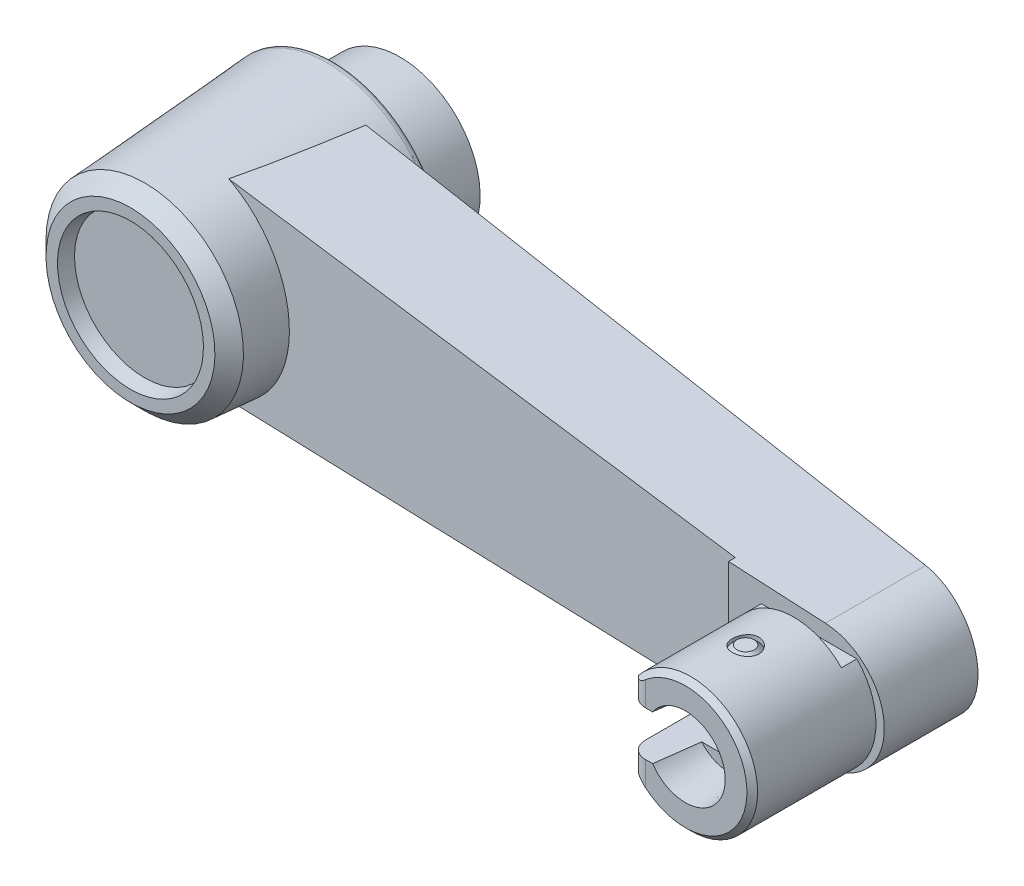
ISO-10303-21;
HEADER;
FILE_DESCRIPTION(('STEP AP214'),'2;1');
FILE_NAME('part.step','',(''),(''),'','','');
FILE_SCHEMA(('AUTOMOTIVE_DESIGN { 1 0 10303 214 1 1 1 1 }'));
ENDSEC;
DATA;
#1=APPLICATION_CONTEXT('core data for automotive mechanical design processes');
#2=APPLICATION_PROTOCOL_DEFINITION('international standard','automotive_design',2000,#1);
#3=PRODUCT_CONTEXT('',#1,'mechanical');
#4=PRODUCT('Part','Part','',(#3));
#5=PRODUCT_RELATED_PRODUCT_CATEGORY('part','',(#4));
#6=PRODUCT_DEFINITION_FORMATION('','',#4);
#7=PRODUCT_DEFINITION_CONTEXT('part definition',#1,'design');
#8=PRODUCT_DEFINITION('design','',#6,#7);
#9=PRODUCT_DEFINITION_SHAPE('','',#8);
#10=(LENGTH_UNIT() NAMED_UNIT(*) SI_UNIT(.MILLI.,.METRE.));
#11=(NAMED_UNIT(*) PLANE_ANGLE_UNIT() SI_UNIT($,.RADIAN.));
#12=(NAMED_UNIT(*) SI_UNIT($,.STERADIAN.) SOLID_ANGLE_UNIT());
#13=UNCERTAINTY_MEASURE_WITH_UNIT(LENGTH_MEASURE(1.E-05),#10,'distance_accuracy_value','');
#14=(GEOMETRIC_REPRESENTATION_CONTEXT(3) GLOBAL_UNCERTAINTY_ASSIGNED_CONTEXT((#13)) GLOBAL_UNIT_ASSIGNED_CONTEXT((#10,
#11,#12)) REPRESENTATION_CONTEXT('',''));
#15=CARTESIAN_POINT('',(0.,0.,0.));
#16=DIRECTION('',(0.,0.,1.));
#17=DIRECTION('',(1.,0.,0.));
#18=AXIS2_PLACEMENT_3D('',#15,#16,#17);
#19=CARTESIAN_POINT('',(87.95,-30.5,39.));
#20=DIRECTION('',(0.,0.,-1.));
#21=DIRECTION('',(1.,0.,0.));
#22=AXIS2_PLACEMENT_3D('',#19,#20,#21);
#23=PLANE('',#22);
#24=CARTESIAN_POINT('',(100.,0.,38.9999999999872));
#25=DIRECTION('',(0.,0.,-1.));
#26=DIRECTION('',(0.,1.,0.));
#27=AXIS2_PLACEMENT_3D('',#24,#25,#26);
#28=CIRCLE('',#27,3.00000000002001);
#29=CARTESIAN_POINT('',(100.,3.00000000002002,38.9999999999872));
#30=VERTEX_POINT('',#29);
#31=EDGE_CURVE('E600',#30,#30,#28,.F.);
#32=ORIENTED_EDGE('',*,*,#31,.T.);
#33=EDGE_LOOP('',(#32));
#34=FACE_BOUND('',#33,.T.);
#35=ADVANCED_FACE('F15',(#34),#23,.F.);
#36=CARTESIAN_POINT('',(100.,0.,39.));
#37=DIRECTION('',(0.,0.,-1.));
#38=DIRECTION('',(0.,1.,0.));
#39=AXIS2_PLACEMENT_3D('',#36,#37,#38);
#40=CIRCLE('',#39,10.);
#41=CARTESIAN_POINT('',(92.8585715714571,-7.,39.));
#42=VERTEX_POINT('',#41);
#43=CARTESIAN_POINT('',(91.5,-5.26782687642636,39.));
#44=VERTEX_POINT('',#43);
#45=EDGE_CURVE('E562',#42,#44,#40,.T.);
#46=ORIENTED_EDGE('',*,*,#45,.T.);
#47=DIRECTION('',(0.,1.,0.));
#48=VECTOR('',#47,1.);
#49=CARTESIAN_POINT('',(91.5,20.,39.));
#50=LINE('',#49,#48);
#51=CARTESIAN_POINT('',(91.5,5.26782687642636,39.));
#52=VERTEX_POINT('',#51);
#53=EDGE_CURVE('E533',#44,#52,#50,.T.);
#54=ORIENTED_EDGE('',*,*,#53,.T.);
#55=CARTESIAN_POINT('',(100.,0.,39.));
#56=DIRECTION('',(0.,0.,-1.));
#57=DIRECTION('',(0.,1.,0.));
#58=AXIS2_PLACEMENT_3D('',#55,#56,#57);
#59=CIRCLE('',#58,10.);
#60=CARTESIAN_POINT('',(92.8585715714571,7.,39.));
#61=VERTEX_POINT('',#60);
#62=EDGE_CURVE('E595',#61,#52,#59,.F.);
#63=ORIENTED_EDGE('',*,*,#62,.F.);
#64=DIRECTION('',(1.,0.,0.));
#65=VECTOR('',#64,1.);
#66=CARTESIAN_POINT('',(95.,7.,39.));
#67=LINE('',#66,#65);
#68=CARTESIAN_POINT('',(107.141428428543,7.,39.));
#69=VERTEX_POINT('',#68);
#70=EDGE_CURVE('E596',#61,#69,#67,.T.);
#71=ORIENTED_EDGE('',*,*,#70,.T.);
#72=CARTESIAN_POINT('',(100.,0.,39.));
#73=DIRECTION('',(0.,0.,-1.));
#74=DIRECTION('',(0.,1.,0.));
#75=AXIS2_PLACEMENT_3D('',#72,#73,#74);
#76=CIRCLE('',#75,10.);
#77=CARTESIAN_POINT('',(107.141428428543,-7.,39.));
#78=VERTEX_POINT('',#77);
#79=EDGE_CURVE('E583',#78,#69,#76,.F.);
#80=ORIENTED_EDGE('',*,*,#79,.F.);
#81=DIRECTION('',(1.,0.,0.));
#82=VECTOR('',#81,1.);
#83=CARTESIAN_POINT('',(95.,-7.,39.));
#84=LINE('',#83,#82);
#85=EDGE_CURVE('E599',#78,#42,#84,.F.);
#86=ORIENTED_EDGE('',*,*,#85,.T.);
#87=EDGE_LOOP('',(#46,#54,#63,#71,#80,#86));
#88=FACE_BOUND('',#87,.T.);
#89=CARTESIAN_POINT('',(101.964285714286,0.,39.));
#90=DIRECTION('',(0.,0.,1.));
#91=DIRECTION('',(0.,-1.,0.));
#92=AXIS2_PLACEMENT_3D('',#89,#90,#91);
#93=CIRCLE('',#92,9.28571428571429);
#94=CARTESIAN_POINT('',(102.446245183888,9.27319820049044,39.));
#95=VERTEX_POINT('',#94);
#96=CARTESIAN_POINT('',(102.446245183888,-9.27319820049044,39.));
#97=VERTEX_POINT('',#96);
#98=EDGE_CURVE('E184',#95,#97,#93,.F.);
#99=ORIENTED_EDGE('',*,*,#98,.F.);
#100=DIRECTION('',(-0.99865211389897,0.0519033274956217,0.));
#101=VECTOR('',#100,1.);
#102=CARTESIAN_POINT('',(102.446245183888,9.27319820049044,39.));
#103=LINE('',#102,#101);
#104=CARTESIAN_POINT('',(87.95,10.0266170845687,39.));
#105=VERTEX_POINT('',#104);
#106=EDGE_CURVE('E168',#105,#95,#103,.F.);
#107=ORIENTED_EDGE('',*,*,#106,.F.);
#108=DIRECTION('',(0.,-1.,0.));
#109=VECTOR('',#108,1.);
#110=CARTESIAN_POINT('',(87.95,-30.5,39.));
#111=LINE('',#110,#109);
#112=CARTESIAN_POINT('',(87.95,-10.0266170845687,39.));
#113=VERTEX_POINT('',#112);
#114=EDGE_CURVE('E220',#113,#105,#111,.F.);
#115=ORIENTED_EDGE('',*,*,#114,.F.);
#116=DIRECTION('',(0.99865211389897,0.0519033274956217,0.));
#117=VECTOR('',#116,1.);
#118=CARTESIAN_POINT('',(0.756646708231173,-14.5583505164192,39.));
#119=LINE('',#118,#117);
#120=EDGE_CURVE('E187',#97,#113,#119,.F.);
#121=ORIENTED_EDGE('',*,*,#120,.F.);
#122=EDGE_LOOP('',(#99,#107,#115,#121));
#123=FACE_BOUND('',#122,.T.);
#124=ADVANCED_FACE('F185',(#88,#123),#23,.F.);
#125=CARTESIAN_POINT('',(101.964285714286,0.,71.));
#126=DIRECTION('',(0.,0.,1.));
#127=DIRECTION('',(0.,-1.,0.));
#128=AXIS2_PLACEMENT_3D('',#125,#126,#127);
#129=CYLINDRICAL_SURFACE('',#128,9.28571428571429);
#130=CARTESIAN_POINT('',(101.964285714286,0.,23.9734375));
#131=DIRECTION('',(-0.108726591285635,0.,0.994071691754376));
#132=DIRECTION('',(0.994071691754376,0.,0.108726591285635));
#133=AXIS2_PLACEMENT_3D('',#130,#131,#132);
#134=ELLIPSE('',#133,9.34109115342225,9.28571428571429);
#135=CARTESIAN_POINT('',(102.446245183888,-9.27319820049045,24.0261518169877));
#136=VERTEX_POINT('',#135);
#137=CARTESIAN_POINT('',(102.446245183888,9.27319820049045,24.0261518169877));
#138=VERTEX_POINT('',#137);
#139=EDGE_CURVE('E196',#136,#138,#134,.T.);
#140=ORIENTED_EDGE('',*,*,#139,.T.);
#141=DIRECTION('',(0.,0.,1.));
#142=VECTOR('',#141,1.);
#143=CARTESIAN_POINT('',(102.446245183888,9.27319820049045,71.));
#144=LINE('',#143,#142);
#145=EDGE_CURVE('E173',#95,#138,#144,.F.);
#146=ORIENTED_EDGE('',*,*,#145,.F.);
#147=ORIENTED_EDGE('',*,*,#98,.T.);
#148=DIRECTION('',(0.,0.,1.));
#149=VECTOR('',#148,1.);
#150=CARTESIAN_POINT('',(102.446245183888,-9.27319820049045,71.));
#151=LINE('',#150,#149);
#152=EDGE_CURVE('E190',#97,#136,#151,.F.);
#153=ORIENTED_EDGE('',*,*,#152,.T.);
#154=EDGE_LOOP('',(#140,#146,#147,#153));
#155=FACE_BOUND('',#154,.T.);
#156=ADVANCED_FACE('F194',(#155),#129,.T.);
#157=CARTESIAN_POINT('',(102.446245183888,9.27319820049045,71.));
#158=DIRECTION('',(0.0519033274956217,0.99865211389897,0.));
#159=DIRECTION('',(-0.99865211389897,0.0519033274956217,0.));
#160=AXIS2_PLACEMENT_3D('',#157,#158,#159);
#161=PLANE('',#160);
#162=ORIENTED_EDGE('',*,*,#145,.T.);
#163=DIRECTION('',(-0.992747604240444,0.0515964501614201,-0.108581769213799));
#164=VECTOR('',#163,1.);
#165=CARTESIAN_POINT('',(102.446245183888,9.27319820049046,24.0261518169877));
#166=LINE('',#165,#164);
#167=CARTESIAN_POINT('',(8.44948129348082,14.1585278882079,13.7452558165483));
#168=VERTEX_POINT('',#167);
#169=EDGE_CURVE('E285',#138,#168,#166,.T.);
#170=ORIENTED_EDGE('',*,*,#169,.T.);
#171=CARTESIAN_POINT('',(5.30577062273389,14.3219171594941,31.1202188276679));
#172=CARTESIAN_POINT('',(5.3896609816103,14.3175570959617,30.7618435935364));
#173=CARTESIAN_POINT('',(5.47158317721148,14.3132993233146,30.4030129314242));
#174=CARTESIAN_POINT('',(5.63195984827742,14.304964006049,29.6845836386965));
#175=CARTESIAN_POINT('',(5.71041440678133,14.3008864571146,29.3249850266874));
#176=CARTESIAN_POINT('',(5.9412704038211,14.288888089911,28.2452958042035));
#177=CARTESIAN_POINT('',(6.08918029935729,14.2812007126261,27.5242420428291));
#178=CARTESIAN_POINT('',(6.37555030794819,14.26631709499,26.0805373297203));
#179=CARTESIAN_POINT('',(6.51401377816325,14.2591206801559,25.3578870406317));
#180=CARTESIAN_POINT('',(6.78330536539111,14.2451246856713,23.9111457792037));
#181=CARTESIAN_POINT('',(6.91413326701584,14.2383251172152,23.1870547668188));
#182=CARTESIAN_POINT('',(7.29715068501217,14.2184184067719,21.0132893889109));
#183=CARTESIAN_POINT('',(7.53990800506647,14.2058014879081,19.561947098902));
#184=CARTESIAN_POINT('',(7.89040633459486,14.1875849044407,17.3824994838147));
#185=CARTESIAN_POINT('',(8.00498604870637,14.1816298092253,16.6554768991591));
#186=CARTESIAN_POINT('',(8.23011898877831,14.1699288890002,15.2008095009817));
#187=CARTESIAN_POINT('',(8.34067223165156,14.1641830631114,14.4731646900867));
#188=CARTESIAN_POINT('',(8.44948128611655,14.1585278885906,13.7452558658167));
#189=B_SPLINE_CURVE_WITH_KNOTS('',3,(#171,#172,#173,#174,#175,#176,#177,#178,#179,#180,#181,
#182,#183,#184,#185,#186,#187,#188),.UNSPECIFIED.,.F.,.F.,(4,2,2,2,2,2,2,2,4),(0.,
1.10425125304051,2.20847604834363,4.41671083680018,6.62415670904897,8.83166482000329,
13.2461445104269,15.454199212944,17.6622446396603),.UNSPECIFIED.);
#190=CARTESIAN_POINT('',(5.30577063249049,14.3219171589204,31.1202188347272));
#191=VERTEX_POINT('',#190);
#192=EDGE_CURVE('E197',#191,#168,#189,.T.);
#193=ORIENTED_EDGE('',*,*,#192,.F.);
#194=DIRECTION('',(0.995218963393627,-0.0517248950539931,0.0828477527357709));
#195=VECTOR('',#194,1.);
#196=CARTESIAN_POINT('',(5.30577062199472,14.3219171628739,31.1202188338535));
#197=LINE('',#196,#195);
#198=CARTESIAN_POINT('',(87.95,10.0266170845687,38.));
#199=VERTEX_POINT('',#198);
#200=EDGE_CURVE('E180',#191,#199,#197,.T.);
#201=ORIENTED_EDGE('',*,*,#200,.T.);
#202=DIRECTION('',(0.,0.,1.));
#203=VECTOR('',#202,1.);
#204=CARTESIAN_POINT('',(87.95,10.0266170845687,38.));
#205=LINE('',#204,#203);
#206=EDGE_CURVE('E176',#199,#105,#205,.T.);
#207=ORIENTED_EDGE('',*,*,#206,.T.);
#208=ORIENTED_EDGE('',*,*,#106,.T.);
#209=EDGE_LOOP('',(#162,#170,#193,#201,#207,#208));
#210=FACE_BOUND('',#209,.T.);
#211=ADVANCED_FACE('F170',(#210),#161,.T.);
#212=CARTESIAN_POINT('',(87.95,-30.5,38.));
#213=DIRECTION('',(1.,0.,0.));
#214=DIRECTION('',(0.,1.,0.));
#215=AXIS2_PLACEMENT_3D('',#212,#213,#214);
#216=PLANE('',#215);
#217=ORIENTED_EDGE('',*,*,#114,.T.);
#218=ORIENTED_EDGE('',*,*,#206,.F.);
#219=DIRECTION('',(0.,-1.,0.));
#220=VECTOR('',#219,1.);
#221=CARTESIAN_POINT('',(87.95,-30.5,38.));
#222=LINE('',#221,#220);
#223=CARTESIAN_POINT('',(87.95,-10.0266170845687,38.));
#224=VERTEX_POINT('',#223);
#225=EDGE_CURVE('E222',#199,#224,#222,.T.);
#226=ORIENTED_EDGE('',*,*,#225,.T.);
#227=DIRECTION('',(0.,0.,1.));
#228=VECTOR('',#227,1.);
#229=CARTESIAN_POINT('',(87.95,-10.0266170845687,38.));
#230=LINE('',#229,#228);
#231=EDGE_CURVE('E235',#113,#224,#230,.F.);
#232=ORIENTED_EDGE('',*,*,#231,.F.);
#233=EDGE_LOOP('',(#217,#218,#226,#232));
#234=FACE_BOUND('',#233,.T.);
#235=ADVANCED_FACE('F255',(#234),#216,.F.);
#236=CARTESIAN_POINT('',(0.756646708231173,-14.5583505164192,71.));
#237=DIRECTION('',(0.0519033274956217,-0.99865211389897,0.));
#238=DIRECTION('',(0.99865211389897,0.0519033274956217,0.));
#239=AXIS2_PLACEMENT_3D('',#236,#237,#238);
#240=PLANE('',#239);
#241=ORIENTED_EDGE('',*,*,#231,.T.);
#242=DIRECTION('',(-0.995218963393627,-0.0517248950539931,-0.0828477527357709));
#243=VECTOR('',#242,1.);
#244=CARTESIAN_POINT('',(87.95,-10.0266170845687,38.));
#245=LINE('',#244,#243);
#246=CARTESIAN_POINT('',(5.30577063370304,-14.3219171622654,31.1202187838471));
#247=VERTEX_POINT('',#246);
#248=EDGE_CURVE('E191',#224,#247,#245,.T.);
#249=ORIENTED_EDGE('',*,*,#248,.T.);
#250=CARTESIAN_POINT('',(8.44948130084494,-14.1585278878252,13.7452557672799));
#251=CARTESIAN_POINT('',(8.34067224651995,-14.1641830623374,14.4731645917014));
#252=CARTESIAN_POINT('',(8.23011900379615,-14.169928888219,15.2008094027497));
#253=CARTESIAN_POINT('',(8.004986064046,-14.1816298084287,16.6554768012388));
#254=CARTESIAN_POINT('',(7.89040635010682,-14.1875849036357,17.3824993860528));
#255=CARTESIAN_POINT('',(7.53990802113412,-14.2058014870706,19.5619470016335));
#256=CARTESIAN_POINT('',(7.29715070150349,-14.2184184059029,21.0132892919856));
#257=CARTESIAN_POINT('',(6.91413328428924,-14.2383251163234,23.1870546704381));
#258=CARTESIAN_POINT('',(6.78330538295,-14.245124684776,23.9111456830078));
#259=CARTESIAN_POINT('',(6.51401379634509,-14.2591206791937,25.3578869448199));
#260=CARTESIAN_POINT('',(6.37555032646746,-14.2663170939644,26.0805372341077));
#261=CARTESIAN_POINT('',(6.08918031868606,-14.2812007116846,27.5242419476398));
#262=CARTESIAN_POINT('',(5.94127042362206,-14.2888880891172,28.2452957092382));
#263=CARTESIAN_POINT('',(5.71041442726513,-14.3008864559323,29.3249849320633));
#264=CARTESIAN_POINT('',(5.63195986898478,-14.3049640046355,29.6845835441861));
#265=CARTESIAN_POINT('',(5.47158319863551,-14.3132993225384,30.4030128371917));
#266=CARTESIAN_POINT('',(5.38966100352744,-14.317557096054,30.7618434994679));
#267=CARTESIAN_POINT('',(5.30577064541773,-14.3219171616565,31.1202187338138));
#268=B_SPLINE_CURVE_WITH_KNOTS('',3,(#250,#251,#252,#253,#254,#255,#256,#257,#258,#259,#260,
#261,#262,#263,#264,#265,#266,#267),.UNSPECIFIED.,.F.,.F.,(4,2,2,2,2,2,2,2,4),(0.,
2.20804542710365,4.41610013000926,8.83057982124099,11.0380879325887,13.2455338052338,
15.4537685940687,16.5579933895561,17.6622446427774),.UNSPECIFIED.);
#269=CARTESIAN_POINT('',(8.44948130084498,-14.1585278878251,13.7452557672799));
#270=VERTEX_POINT('',#269);
#271=EDGE_CURVE('E212',#270,#247,#268,.T.);
#272=ORIENTED_EDGE('',*,*,#271,.F.);
#273=DIRECTION('',(0.992747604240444,0.0515964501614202,0.108581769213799));
#274=VECTOR('',#273,1.);
#275=CARTESIAN_POINT('',(8.44948130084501,-14.1585278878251,13.7452557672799));
#276=LINE('',#275,#274);
#277=EDGE_CURVE('E215',#270,#136,#276,.T.);
#278=ORIENTED_EDGE('',*,*,#277,.T.);
#279=ORIENTED_EDGE('',*,*,#152,.F.);
#280=ORIENTED_EDGE('',*,*,#120,.T.);
#281=EDGE_LOOP('',(#241,#249,#272,#278,#279,#280));
#282=FACE_BOUND('',#281,.T.);
#283=ADVANCED_FACE('F300',(#282),#240,.T.);
#284=CARTESIAN_POINT('',(111.35,-30.5,25.));
#285=DIRECTION('',(-0.108726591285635,0.,0.994071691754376));
#286=DIRECTION('',(-0.994071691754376,0.,-0.108726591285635));
#287=AXIS2_PLACEMENT_3D('',#284,#285,#286);
#288=PLANE('',#287);
#289=CARTESIAN_POINT('',(-0.126606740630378,0.,12.8072461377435));
#290=DIRECTION('',(-0.108726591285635,0.,0.994071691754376));
#291=DIRECTION('',(-0.994071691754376,0.,-0.108726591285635));
#292=AXIS2_PLACEMENT_3D('',#289,#290,#291);
#293=ELLIPSE('',#292,16.6524188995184,16.5532140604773);
#294=EDGE_CURVE('E281',#168,#270,#293,.F.);
#295=ORIENTED_EDGE('',*,*,#294,.F.);
#296=ORIENTED_EDGE('',*,*,#169,.F.);
#297=ORIENTED_EDGE('',*,*,#139,.F.);
#298=ORIENTED_EDGE('',*,*,#277,.F.);
#299=EDGE_LOOP('',(#295,#296,#297,#298));
#300=FACE_BOUND('',#299,.T.);
#301=ADVANCED_FACE('F309',(#300),#288,.F.);
#302=CARTESIAN_POINT('',(0.,0.,11.0697564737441));
#303=DIRECTION('',(0.,0.,-1.));
#304=DIRECTION('',(0.,1.,0.));
#305=AXIS2_PLACEMENT_3D('',#302,#303,#304);
#306=CONICAL_SURFACE('',#305,16.6751953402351,0.0698131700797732);
#307=CARTESIAN_POINT('',(0.,0.,11.0697564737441));
#308=DIRECTION('',(0.,0.,-1.));
#309=DIRECTION('',(-1.,0.,0.));
#310=AXIS2_PLACEMENT_3D('',#307,#308,#309);
#311=CIRCLE('',#310,16.6751953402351);
#312=CARTESIAN_POINT('',(-16.6751953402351,0.,11.0697564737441));
#313=VERTEX_POINT('',#312);
#314=EDGE_CURVE('E200',#313,#313,#311,.F.);
#315=ORIENTED_EDGE('',*,*,#314,.T.);
#316=EDGE_LOOP('',(#315));
#317=FACE_BOUND('',#316,.T.);
#318=ORIENTED_EDGE('',*,*,#192,.T.);
#319=ORIENTED_EDGE('',*,*,#294,.T.);
#320=ORIENTED_EDGE('',*,*,#271,.T.);
#321=CARTESIAN_POINT('',(-0.0890893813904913,0.,30.6711196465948));
#322=DIRECTION('',(0.082958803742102,0.,-0.996552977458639));
#323=DIRECTION('',(-0.996552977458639,0.,-0.082958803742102));
#324=AXIS2_PLACEMENT_3D('',#321,#322,#323);
#325=ELLIPSE('',#324,15.3574720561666,15.3042752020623);
#326=EDGE_CURVE('E216',#247,#191,#325,.F.);
#327=ORIENTED_EDGE('',*,*,#326,.T.);
#328=EDGE_LOOP('',(#318,#319,#320,#327));
#329=FACE_BOUND('',#328,.T.);
#330=CARTESIAN_POINT('',(0.,0.,38.365));
#331=DIRECTION('',(0.,0.,-1.));
#332=DIRECTION('',(-1.,0.,0.));
#333=AXIS2_PLACEMENT_3D('',#330,#331,#332);
#334=CIRCLE('',#333,14.7665259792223);
#335=CARTESIAN_POINT('',(-14.7665259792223,0.,38.365));
#336=VERTEX_POINT('',#335);
#337=EDGE_CURVE('E213',#336,#336,#334,.T.);
#338=ORIENTED_EDGE('',*,*,#337,.T.);
#339=EDGE_LOOP('',(#338));
#340=FACE_BOUND('',#339,.T.);
#341=ADVANCED_FACE('F304',(#317,#329,#340),#306,.T.);
#342=CARTESIAN_POINT('',(-13.3764896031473,-30.5,29.565));
#343=DIRECTION('',(0.082958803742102,0.,-0.996552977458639));
#344=DIRECTION('',(0.996552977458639,0.,0.082958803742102));
#345=AXIS2_PLACEMENT_3D('',#342,#343,#344);
#346=PLANE('',#345);
#347=ORIENTED_EDGE('',*,*,#326,.F.);
#348=ORIENTED_EDGE('',*,*,#248,.F.);
#349=ORIENTED_EDGE('',*,*,#225,.F.);
#350=ORIENTED_EDGE('',*,*,#200,.F.);
#351=EDGE_LOOP('',(#347,#348,#349,#350));
#352=FACE_BOUND('',#351,.T.);
#353=ADVANCED_FACE('F308',(#352),#346,.F.);
#354=CARTESIAN_POINT('',(0.,0.,38.365));
#355=DIRECTION('',(0.,0.,-1.));
#356=DIRECTION('',(0.,1.,0.));
#357=AXIS2_PLACEMENT_3D('',#354,#355,#356);
#358=CONICAL_SURFACE('',#357,14.7665259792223,0.785398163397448);
#359=ORIENTED_EDGE('',*,*,#337,.F.);
#360=EDGE_LOOP('',(#359));
#361=FACE_BOUND('',#360,.T.);
#362=CARTESIAN_POINT('',(0.,0.,40.5));
#363=DIRECTION('',(0.,0.,-1.));
#364=DIRECTION('',(0.,1.,0.));
#365=AXIS2_PLACEMENT_3D('',#362,#363,#364);
#366=CIRCLE('',#365,12.6315259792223);
#367=CARTESIAN_POINT('',(0.,12.6315259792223,40.5));
#368=VERTEX_POINT('',#367);
#369=EDGE_CURVE('E228',#368,#368,#366,.T.);
#370=ORIENTED_EDGE('',*,*,#369,.T.);
#371=EDGE_LOOP('',(#370));
#372=FACE_BOUND('',#371,.T.);
#373=ADVANCED_FACE('F252',(#361,#372),#358,.T.);
#374=CARTESIAN_POINT('',(0.,0.,11.));
#375=DIRECTION('',(0.,0.,-1.));
#376=DIRECTION('',(0.,1.,0.));
#377=AXIS2_PLACEMENT_3D('',#374,#375,#376);
#378=TOROIDAL_SURFACE('',#377,15.6776312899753,1.);
#379=CARTESIAN_POINT('',(0.,0.,10.));
#380=DIRECTION('',(0.,0.,1.));
#381=DIRECTION('',(-1.,0.,0.));
#382=AXIS2_PLACEMENT_3D('',#379,#380,#381);
#383=CIRCLE('',#382,15.6776312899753);
#384=CARTESIAN_POINT('',(-15.6776312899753,0.,10.));
#385=VERTEX_POINT('',#384);
#386=CARTESIAN_POINT('',(0.,-15.6776312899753,10.));
#387=VERTEX_POINT('',#386);
#388=EDGE_CURVE('E1105',#385,#387,#383,.T.);
#389=ORIENTED_EDGE('',*,*,#388,.T.);
#390=CARTESIAN_POINT('',(0.,0.,10.));
#391=DIRECTION('',(0.,0.,1.));
#392=DIRECTION('',(0.,-1.,0.));
#393=AXIS2_PLACEMENT_3D('',#390,#391,#392);
#394=CIRCLE('',#393,15.6776312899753);
#395=CARTESIAN_POINT('',(0.,15.6776312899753,10.));
#396=VERTEX_POINT('',#395);
#397=EDGE_CURVE('E236',#387,#396,#394,.T.);
#398=ORIENTED_EDGE('',*,*,#397,.T.);
#399=CARTESIAN_POINT('',(0.,0.,10.));
#400=DIRECTION('',(0.,0.,1.));
#401=DIRECTION('',(0.,1.,0.));
#402=AXIS2_PLACEMENT_3D('',#399,#400,#401);
#403=CIRCLE('',#402,15.6776312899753);
#404=EDGE_CURVE('E1088',#396,#385,#403,.T.);
#405=ORIENTED_EDGE('',*,*,#404,.T.);
#406=EDGE_LOOP('',(#389,#398,#405));
#407=FACE_BOUND('',#406,.T.);
#408=ORIENTED_EDGE('',*,*,#314,.F.);
#409=EDGE_LOOP('',(#408));
#410=FACE_BOUND('',#409,.T.);
#411=ADVANCED_FACE('F246',(#407,#410),#378,.T.);
#412=CARTESIAN_POINT('',(-11.7732639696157,0.,40.5));
#413=DIRECTION('',(0.,0.,1.));
#414=DIRECTION('',(0.,-1.,0.));
#415=AXIS2_PLACEMENT_3D('',#412,#413,#414);
#416=PLANE('',#415);
#417=CARTESIAN_POINT('',(0.,0.,40.5));
#418=DIRECTION('',(0.,0.,1.));
#419=DIRECTION('',(0.,-1.,0.));
#420=AXIS2_PLACEMENT_3D('',#417,#418,#419);
#421=CIRCLE('',#420,10.915001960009);
#422=CARTESIAN_POINT('',(0.,-10.915001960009,40.5));
#423=VERTEX_POINT('',#422);
#424=EDGE_CURVE('E223',#423,#423,#421,.F.);
#425=ORIENTED_EDGE('',*,*,#424,.T.);
#426=EDGE_LOOP('',(#425));
#427=FACE_BOUND('',#426,.T.);
#428=ORIENTED_EDGE('',*,*,#369,.F.);
#429=EDGE_LOOP('',(#428));
#430=FACE_BOUND('',#429,.T.);
#431=ADVANCED_FACE('F251',(#427,#430),#416,.T.);
#432=CARTESIAN_POINT('',(-13.8388156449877,0.,10.));
#433=DIRECTION('',(0.,0.,-1.));
#434=DIRECTION('',(0.,1.,0.));
#435=AXIS2_PLACEMENT_3D('',#432,#433,#434);
#436=PLANE('',#435);
#437=ORIENTED_EDGE('',*,*,#397,.F.);
#438=ORIENTED_EDGE('',*,*,#388,.F.);
#439=ORIENTED_EDGE('',*,*,#404,.F.);
#440=EDGE_LOOP('',(#437,#438,#439));
#441=FACE_BOUND('',#440,.T.);
#442=CARTESIAN_POINT('',(0.,0.,10.));
#443=DIRECTION('',(0.,0.,1.));
#444=DIRECTION('',(0.,-1.,0.));
#445=AXIS2_PLACEMENT_3D('',#442,#443,#444);
#446=CIRCLE('',#445,12.);
#447=CARTESIAN_POINT('',(0.,-12.,10.));
#448=VERTEX_POINT('',#447);
#449=EDGE_CURVE('E1089',#448,#448,#446,.T.);
#450=ORIENTED_EDGE('',*,*,#449,.T.);
#451=EDGE_LOOP('',(#450));
#452=FACE_BOUND('',#451,.T.);
#453=ADVANCED_FACE('F857',(#441,#452),#436,.T.);
#454=CARTESIAN_POINT('',(0.,0.,40.5));
#455=DIRECTION('',(0.,0.,1.));
#456=DIRECTION('',(0.,-1.,0.));
#457=AXIS2_PLACEMENT_3D('',#454,#455,#456);
#458=CONICAL_SURFACE('',#457,10.915001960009,0.191986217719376);
#459=ORIENTED_EDGE('',*,*,#424,.F.);
#460=EDGE_LOOP('',(#459));
#461=FACE_BOUND('',#460,.T.);
#462=CARTESIAN_POINT('',(0.,0.,38.365));
#463=DIRECTION('',(0.,0.,1.));
#464=DIRECTION('',(0.,-1.,0.));
#465=AXIS2_PLACEMENT_3D('',#462,#463,#464);
#466=CIRCLE('',#465,10.5);
#467=CARTESIAN_POINT('',(0.,-10.5,38.365));
#468=VERTEX_POINT('',#467);
#469=EDGE_CURVE('E1085',#468,#468,#466,.T.);
#470=ORIENTED_EDGE('',*,*,#469,.F.);
#471=EDGE_LOOP('',(#470));
#472=FACE_BOUND('',#471,.T.);
#473=ADVANCED_FACE('F254',(#461,#472),#458,.F.);
#474=CARTESIAN_POINT('',(0.,0.,5.1));
#475=DIRECTION('',(0.,0.,1.));
#476=DIRECTION('',(0.,-1.,0.));
#477=AXIS2_PLACEMENT_3D('',#474,#475,#476);
#478=CYLINDRICAL_SURFACE('',#477,12.);
#479=CARTESIAN_POINT('',(0.,0.,0.2));
#480=DIRECTION('',(0.,0.,1.));
#481=DIRECTION('',(0.,-1.,0.));
#482=AXIS2_PLACEMENT_3D('',#479,#480,#481);
#483=CIRCLE('',#482,12.);
#484=CARTESIAN_POINT('',(0.,-12.,0.200000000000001));
#485=VERTEX_POINT('',#484);
#486=EDGE_CURVE('E1092',#485,#485,#483,.T.);
#487=ORIENTED_EDGE('',*,*,#486,.T.);
#488=EDGE_LOOP('',(#487));
#489=FACE_BOUND('',#488,.T.);
#490=ORIENTED_EDGE('',*,*,#449,.F.);
#491=EDGE_LOOP('',(#490));
#492=FACE_BOUND('',#491,.T.);
#493=ADVANCED_FACE('F849',(#489,#492),#478,.T.);
#494=CARTESIAN_POINT('',(-5.25,0.,38.365));
#495=DIRECTION('',(0.,0.,1.));
#496=DIRECTION('',(0.,-1.,0.));
#497=AXIS2_PLACEMENT_3D('',#494,#495,#496);
#498=PLANE('',#497);
#499=ORIENTED_EDGE('',*,*,#469,.T.);
#500=EDGE_LOOP('',(#499));
#501=FACE_BOUND('',#500,.T.);
#502=ADVANCED_FACE('F846',(#501),#498,.T.);
#503=CARTESIAN_POINT('',(-10.5,0.,0.2));
#504=DIRECTION('',(0.,0.,-1.));
#505=DIRECTION('',(1.,0.,0.));
#506=AXIS2_PLACEMENT_3D('',#503,#504,#505);
#507=PLANE('',#506);
#508=ORIENTED_EDGE('',*,*,#486,.F.);
#509=EDGE_LOOP('',(#508));
#510=FACE_BOUND('',#509,.T.);
#511=CARTESIAN_POINT('',(0.,0.,0.200000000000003));
#512=DIRECTION('',(0.,0.,1.));
#513=DIRECTION('',(0.,-1.,0.));
#514=AXIS2_PLACEMENT_3D('',#511,#512,#513);
#515=CIRCLE('',#514,9.);
#516=CARTESIAN_POINT('',(0.,-9.,0.200000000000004));
#517=VERTEX_POINT('',#516);
#518=EDGE_CURVE('E1095',#517,#517,#515,.T.);
#519=ORIENTED_EDGE('',*,*,#518,.T.);
#520=EDGE_LOOP('',(#519));
#521=FACE_BOUND('',#520,.T.);
#522=ADVANCED_FACE('F838',(#510,#521),#507,.T.);
#523=CARTESIAN_POINT('',(0.,0.,0.1));
#524=DIRECTION('',(0.,0.,1.));
#525=DIRECTION('',(0.,-1.,0.));
#526=AXIS2_PLACEMENT_3D('',#523,#524,#525);
#527=CYLINDRICAL_SURFACE('',#526,9.);
#528=CARTESIAN_POINT('',(0.,0.,0.));
#529=DIRECTION('',(0.,0.,1.));
#530=DIRECTION('',(0.,-1.,0.));
#531=AXIS2_PLACEMENT_3D('',#528,#529,#530);
#532=CIRCLE('',#531,9.);
#533=CARTESIAN_POINT('',(0.,-9.,0.));
#534=VERTEX_POINT('',#533);
#535=EDGE_CURVE('E1098',#534,#534,#532,.T.);
#536=ORIENTED_EDGE('',*,*,#535,.T.);
#537=EDGE_LOOP('',(#536));
#538=FACE_BOUND('',#537,.T.);
#539=ORIENTED_EDGE('',*,*,#518,.F.);
#540=EDGE_LOOP('',(#539));
#541=FACE_BOUND('',#540,.T.);
#542=ADVANCED_FACE('F830',(#538,#541),#527,.T.);
#543=CARTESIAN_POINT('',(-4.5,0.,0.));
#544=DIRECTION('',(0.,0.,-1.));
#545=DIRECTION('',(0.,1.,0.));
#546=AXIS2_PLACEMENT_3D('',#543,#544,#545);
#547=PLANE('',#546);
#548=ORIENTED_EDGE('',*,*,#535,.F.);
#549=EDGE_LOOP('',(#548));
#550=FACE_BOUND('',#549,.T.);
#551=CARTESIAN_POINT('',(0.,0.,0.));
#552=DIRECTION('',(0.,0.,-1.));
#553=DIRECTION('',(0.,1.,0.));
#554=AXIS2_PLACEMENT_3D('',#551,#552,#553);
#555=CIRCLE('',#554,6.83750000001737);
#556=CARTESIAN_POINT('',(0.,6.83750000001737,0.));
#557=VERTEX_POINT('',#556);
#558=EDGE_CURVE('E277',#557,#557,#555,.F.);
#559=ORIENTED_EDGE('',*,*,#558,.T.);
#560=EDGE_LOOP('',(#559));
#561=FACE_BOUND('',#560,.T.);
#562=ADVANCED_FACE('F822',(#550,#561),#547,.T.);
#563=CARTESIAN_POINT('',(0.,0.,0.));
#564=DIRECTION('',(0.,0.,-1.));
#565=DIRECTION('',(0.,1.,0.));
#566=AXIS2_PLACEMENT_3D('',#563,#564,#565);
#567=CONICAL_SURFACE('',#566,6.83750000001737,0.785398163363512);
#568=ORIENTED_EDGE('',*,*,#558,.F.);
#569=EDGE_LOOP('',(#568));
#570=FACE_BOUND('',#569,.T.);
#571=CARTESIAN_POINT('',(0.,0.,0.837499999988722));
#572=DIRECTION('',(0.,0.,-1.));
#573=DIRECTION('',(1.,0.,0.));
#574=AXIS2_PLACEMENT_3D('',#571,#572,#573);
#575=CIRCLE('',#574,6.00000000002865);
#576=CARTESIAN_POINT('',(6.00000000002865,0.,0.837499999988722));
#577=VERTEX_POINT('',#576);
#578=EDGE_CURVE('E269',#577,#577,#575,.T.);
#579=ORIENTED_EDGE('',*,*,#578,.F.);
#580=EDGE_LOOP('',(#579));
#581=FACE_BOUND('',#580,.T.);
#582=ADVANCED_FACE('F815',(#570,#581),#567,.F.);
#583=CARTESIAN_POINT('',(0.,0.,12.41875));
#584=DIRECTION('',(0.,0.,-1.));
#585=DIRECTION('',(0.,1.,0.));
#586=AXIS2_PLACEMENT_3D('',#583,#584,#585);
#587=CYLINDRICAL_SURFACE('',#586,6.);
#588=ORIENTED_EDGE('',*,*,#578,.T.);
#589=EDGE_LOOP('',(#588));
#590=FACE_BOUND('',#589,.T.);
#591=CARTESIAN_POINT('',(0.,0.,24.));
#592=DIRECTION('',(0.,0.,-1.));
#593=DIRECTION('',(0.,1.,0.));
#594=AXIS2_PLACEMENT_3D('',#591,#592,#593);
#595=CIRCLE('',#594,6.);
#596=CARTESIAN_POINT('',(0.,6.,24.));
#597=VERTEX_POINT('',#596);
#598=EDGE_CURVE('E278',#597,#597,#595,.T.);
#599=ORIENTED_EDGE('',*,*,#598,.F.);
#600=EDGE_LOOP('',(#599));
#601=FACE_BOUND('',#600,.T.);
#602=ADVANCED_FACE('F808',(#590,#601),#587,.F.);
#603=CARTESIAN_POINT('',(0.,0.,24.0000000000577));
#604=DIRECTION('',(0.,0.,-1.));
#605=DIRECTION('',(0.,1.,0.));
#606=AXIS2_PLACEMENT_3D('',#603,#604,#605);
#607=CONICAL_SURFACE('',#606,5.99999999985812,1.04719755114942);
#608=CARTESIAN_POINT('',(2.55795384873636E-10,0.,27.4641016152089));
#609=VERTEX_POINT('',#608);
#610=VERTEX_LOOP('',#609);
#611=FACE_BOUND('',#610,.T.);
#612=ORIENTED_EDGE('',*,*,#598,.T.);
#613=EDGE_LOOP('',(#612));
#614=FACE_BOUND('',#613,.T.);
#615=ADVANCED_FACE('F17',(#611,#614),#607,.F.);
#616=CARTESIAN_POINT('',(100.,0.,39.0000000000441));
#617=DIRECTION('',(0.,0.,-1.));
#618=DIRECTION('',(0.,1.,0.));
#619=AXIS2_PLACEMENT_3D('',#616,#617,#618);
#620=CONICAL_SURFACE('',#619,2.99999999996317,0.785398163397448);
#621=ORIENTED_EDGE('',*,*,#31,.F.);
#622=EDGE_LOOP('',(#621));
#623=FACE_BOUND('',#622,.T.);
#624=CARTESIAN_POINT('',(100.,0.,39.5414999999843));
#625=DIRECTION('',(0.,0.,-1.));
#626=DIRECTION('',(-1.,0.,0.));
#627=AXIS2_PLACEMENT_3D('',#624,#625,#626);
#628=CIRCLE('',#627,2.45850000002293);
#629=CARTESIAN_POINT('',(97.5414999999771,0.,39.5414999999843));
#630=VERTEX_POINT('',#629);
#631=EDGE_CURVE('E504',#630,#630,#628,.T.);
#632=ORIENTED_EDGE('',*,*,#631,.F.);
#633=EDGE_LOOP('',(#632));
#634=FACE_BOUND('',#633,.T.);
#635=ADVANCED_FACE('F353',(#623,#634),#620,.F.);
#636=CARTESIAN_POINT('',(100.,0.,41.5));
#637=DIRECTION('',(0.,0.,-1.));
#638=DIRECTION('',(0.,1.,0.));
#639=AXIS2_PLACEMENT_3D('',#636,#637,#638);
#640=CYLINDRICAL_SURFACE('',#639,2.4585);
#641=ORIENTED_EDGE('',*,*,#631,.T.);
#642=EDGE_LOOP('',(#641));
#643=FACE_BOUND('',#642,.T.);
#644=CARTESIAN_POINT('',(100.,0.,43.4584999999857));
#645=DIRECTION('',(0.,0.,1.));
#646=DIRECTION('',(-1.,0.,0.));
#647=AXIS2_PLACEMENT_3D('',#644,#645,#646);
#648=CIRCLE('',#647,2.45849999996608);
#649=CARTESIAN_POINT('',(97.5415000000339,0.,43.4584999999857));
#650=VERTEX_POINT('',#649);
#651=EDGE_CURVE('E494',#650,#650,#648,.T.);
#652=ORIENTED_EDGE('',*,*,#651,.T.);
#653=EDGE_LOOP('',(#652));
#654=FACE_BOUND('',#653,.T.);
#655=ADVANCED_FACE('F349',(#643,#654),#640,.F.);
#656=CARTESIAN_POINT('',(100.,0.,47.85));
#657=DIRECTION('',(0.,0.,-1.));
#658=DIRECTION('',(0.,1.,0.));
#659=AXIS2_PLACEMENT_3D('',#656,#657,#658);
#660=CYLINDRICAL_SURFACE('',#659,10.);
#661=CARTESIAN_POINT('',(101.99,9.79999489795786,48.5));
#662=CARTESIAN_POINT('',(101.989994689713,9.79999763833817,48.6104701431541));
#663=CARTESIAN_POINT('',(101.980761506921,9.80188491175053,48.7210777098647));
#664=CARTESIAN_POINT('',(101.944077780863,9.80922511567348,48.9392530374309));
#665=CARTESIAN_POINT('',(101.916591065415,9.81468512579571,49.0468143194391));
#666=CARTESIAN_POINT('',(101.844283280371,9.82852805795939,49.2555774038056));
#667=CARTESIAN_POINT('',(101.79948727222,9.83690675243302,49.3567881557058));
#668=CARTESIAN_POINT('',(101.693892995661,9.85563737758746,49.5502237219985));
#669=CARTESIAN_POINT('',(101.633099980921,9.86598866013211,49.6424514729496));
#670=CARTESIAN_POINT('',(101.496316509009,9.8876629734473,49.8166447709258));
#671=CARTESIAN_POINT('',(101.420143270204,9.89899665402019,49.8984655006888));
#672=CARTESIAN_POINT('',(101.255152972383,9.92126545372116,50.0482598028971));
#673=CARTESIAN_POINT('',(101.166334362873,9.93220052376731,50.1162316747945));
#674=CARTESIAN_POINT('',(100.977629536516,9.95255291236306,50.2369488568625));
#675=CARTESIAN_POINT('',(100.877654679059,9.96195636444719,50.2895581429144));
#676=CARTESIAN_POINT('',(100.670067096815,9.97806764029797,50.3771784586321));
#677=CARTESIAN_POINT('',(100.562455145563,9.98477573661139,50.4121912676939));
#678=CARTESIAN_POINT('',(100.3441370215,9.99466601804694,50.4631787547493));
#679=CARTESIAN_POINT('',(100.233489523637,9.99789305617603,50.4793958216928));
#680=CARTESIAN_POINT('',(100.011000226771,10.0006125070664,50.4930876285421));
#681=CARTESIAN_POINT('',(99.8991585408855,10.0001052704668,50.4905641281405));
#682=CARTESIAN_POINT('',(99.6791220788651,9.99544811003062,50.4670304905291));
#683=CARTESIAN_POINT('',(99.5708981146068,9.99134966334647,50.4462815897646));
#684=CARTESIAN_POINT('',(99.3594985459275,9.98002857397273,50.3873001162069));
#685=CARTESIAN_POINT('',(99.256323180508,9.97280578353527,50.3490667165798));
#686=CARTESIAN_POINT('',(99.0572011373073,9.95596237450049,50.2559575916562));
#687=CARTESIAN_POINT('',(98.9613039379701,9.94632697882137,50.2009788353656));
#688=CARTESIAN_POINT('',(98.7800066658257,9.92572178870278,50.0760201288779));
#689=CARTESIAN_POINT('',(98.6946070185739,9.91475194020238,50.0060395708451));
#690=CARTESIAN_POINT('',(98.5351854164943,9.89246776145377,49.8516436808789));
#691=CARTESIAN_POINT('',(98.4613826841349,9.88115074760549,49.7670022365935));
#692=CARTESIAN_POINT('',(98.3289516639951,9.85962042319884,49.5863881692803));
#693=CARTESIAN_POINT('',(98.2703301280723,9.84940760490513,49.4904105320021));
#694=CARTESIAN_POINT('',(98.169854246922,9.8312354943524,49.2895088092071));
#695=CARTESIAN_POINT('',(98.1280487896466,9.82328279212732,49.1845596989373));
#696=CARTESIAN_POINT('',(98.0628113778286,9.81062801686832,48.9690667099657));
#697=CARTESIAN_POINT('',(98.0393406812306,9.80591909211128,48.858535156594));
#698=CARTESIAN_POINT('',(98.0202556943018,9.80207265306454,48.7059689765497));
#699=CARTESIAN_POINT('',(98.0164131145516,9.80129532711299,48.664878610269));
#700=CARTESIAN_POINT('',(98.0112842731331,9.80025593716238,48.5825318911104));
#701=CARTESIAN_POINT('',(98.0099980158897,9.79999387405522,48.5412755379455));
#702=CARTESIAN_POINT('',(98.0100053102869,9.79999763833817,48.3895298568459));
#703=CARTESIAN_POINT('',(98.0192384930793,9.80188491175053,48.2789222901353));
#704=CARTESIAN_POINT('',(98.055922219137,9.80922511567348,48.0607469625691));
#705=CARTESIAN_POINT('',(98.0834089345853,9.81468512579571,47.9531856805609));
#706=CARTESIAN_POINT('',(98.1557167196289,9.82852805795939,47.7444225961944));
#707=CARTESIAN_POINT('',(98.2005127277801,9.83690675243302,47.6432118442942));
#708=CARTESIAN_POINT('',(98.3061070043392,9.85563737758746,47.4497762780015));
#709=CARTESIAN_POINT('',(98.366900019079,9.86598866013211,47.3575485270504));
#710=CARTESIAN_POINT('',(98.5036834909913,9.8876629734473,47.1833552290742));
#711=CARTESIAN_POINT('',(98.5798567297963,9.89899665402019,47.1015344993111));
#712=CARTESIAN_POINT('',(98.7448470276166,9.92126545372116,46.9517401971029));
#713=CARTESIAN_POINT('',(98.8336656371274,9.93220052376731,46.8837683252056));
#714=CARTESIAN_POINT('',(99.022370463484,9.95255291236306,46.7630511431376));
#715=CARTESIAN_POINT('',(99.1223453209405,9.96195636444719,46.7104418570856));
#716=CARTESIAN_POINT('',(99.3299329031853,9.97806764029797,46.6228215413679));
#717=CARTESIAN_POINT('',(99.4375448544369,9.98477573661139,46.5878087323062));
#718=CARTESIAN_POINT('',(99.6558629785,9.99466601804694,46.5368212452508));
#719=CARTESIAN_POINT('',(99.7665104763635,9.99789305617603,46.5206041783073));
#720=CARTESIAN_POINT('',(99.9889997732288,10.0006125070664,46.5069123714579));
#721=CARTESIAN_POINT('',(100.100841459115,10.0001052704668,46.5094358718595));
#722=CARTESIAN_POINT('',(100.320877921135,9.99544811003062,46.5329695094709));
#723=CARTESIAN_POINT('',(100.429101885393,9.99134966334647,46.5537184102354));
#724=CARTESIAN_POINT('',(100.640501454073,9.98002857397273,46.6126998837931));
#725=CARTESIAN_POINT('',(100.743676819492,9.97280578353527,46.6509332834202));
#726=CARTESIAN_POINT('',(100.942798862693,9.95596237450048,46.7440424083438));
#727=CARTESIAN_POINT('',(101.03869606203,9.94632697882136,46.7990211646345));
#728=CARTESIAN_POINT('',(101.219993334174,9.92572178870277,46.9239798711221));
#729=CARTESIAN_POINT('',(101.305392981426,9.91475194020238,46.9939604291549));
#730=CARTESIAN_POINT('',(101.464814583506,9.89246776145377,47.1483563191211));
#731=CARTESIAN_POINT('',(101.538617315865,9.88115074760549,47.2329977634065));
#732=CARTESIAN_POINT('',(101.671048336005,9.85962042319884,47.4136118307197));
#733=CARTESIAN_POINT('',(101.729669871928,9.84940760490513,47.509589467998));
#734=CARTESIAN_POINT('',(101.830145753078,9.8312354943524,47.710491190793));
#735=CARTESIAN_POINT('',(101.871951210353,9.82328279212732,47.8154403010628));
#736=CARTESIAN_POINT('',(101.937188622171,9.81062801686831,48.0309332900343));
#737=CARTESIAN_POINT('',(101.960659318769,9.80591909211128,48.141464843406));
#738=CARTESIAN_POINT('',(101.979744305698,9.80207265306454,48.2940310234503));
#739=CARTESIAN_POINT('',(101.983586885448,9.80129532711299,48.3351213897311));
#740=CARTESIAN_POINT('',(101.988715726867,9.80025593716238,48.4174681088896));
#741=CARTESIAN_POINT('',(101.99000198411,9.79999387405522,48.4587244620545));
#742=CARTESIAN_POINT('',(101.99,9.79999489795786,48.5));
#743=B_SPLINE_CURVE_WITH_KNOTS('',3,(#661,#662,#663,#664,#665,#666,#667,#668,#669,#670,#671,
#672,#673,#674,#675,#676,#677,#678,#679,#680,#681,#682,#683,#684,#685,#686,#687,#688,#689,#690,
#691,#692,#693,#694,#695,#696,#697,#698,#699,#700,#701,#702,#703,#704,#705,#706,#707,#708,#709,
#710,#711,#712,#713,#714,#715,#716,#717,#718,#719,#720,#721,#722,#723,#724,#725,#726,#727,#728,
#729,#730,#731,#732,#733,#734,#735,#736,#737,#738,#739,#740,#741,#742),.UNSPECIFIED.,.T.,.F.,(4,
2,2,2,2,2,2,2,2,2,2,2,2,2,2,2,2,2,2,2,2,2,2,2,2,2,2,2,2,2,2,2,2,2,2,2,2,2,2,2,4),(0.,
0.331252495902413,0.663163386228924,0.994595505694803,1.32591891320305,1.66143992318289,
1.99700210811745,2.3354511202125,2.67386590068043,3.00786615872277,3.34183505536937,
3.67109367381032,4.00036786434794,4.33171040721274,4.66306637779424,5.00008140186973,
5.33724605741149,5.67538395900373,6.01280541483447,6.13657280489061,6.2603404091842,
6.5915929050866,6.92350379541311,7.25493591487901,7.58625932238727,7.92178033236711,
8.25734251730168,8.59579152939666,8.93420630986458,9.26820656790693,9.60217546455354,
9.93143408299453,10.2607082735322,10.592050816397,10.9234067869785,11.260421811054,
11.5975864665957,11.935724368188,12.2731458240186,12.3969132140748,12.5206808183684),.UNSPECIFIED.);
#744=CARTESIAN_POINT('',(101.99,9.79999489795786,48.5));
#745=VERTEX_POINT('',#744);
#746=EDGE_CURVE('E9',#745,#745,#743,.T.);
#747=ORIENTED_EDGE('',*,*,#746,.T.);
#748=EDGE_LOOP('',(#747));
#749=FACE_BOUND('',#748,.T.);
#750=CARTESIAN_POINT('',(91.5,5.26782687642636,55.));
#751=CARTESIAN_POINT('',(91.4999939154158,5.26781361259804,55.0407404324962));
#752=CARTESIAN_POINT('',(91.5009964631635,5.26943497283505,55.081457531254));
#753=CARTESIAN_POINT('',(91.5049584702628,5.27582141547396,55.1624971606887));
#754=CARTESIAN_POINT('',(91.507915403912,5.28058244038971,55.2028201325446));
#755=CARTESIAN_POINT('',(91.5194939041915,5.29917282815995,55.3214260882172));
#756=CARTESIAN_POINT('',(91.5308282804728,5.31731957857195,55.3987996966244));
#757=CARTESIAN_POINT('',(91.5639824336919,5.36980465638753,55.5705293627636));
#758=CARTESIAN_POINT('',(91.5878612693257,5.40727104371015,55.6634983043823));
#759=CARTESIAN_POINT('',(91.6442661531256,5.49403389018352,55.8422883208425));
#760=CARTESIAN_POINT('',(91.6769031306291,5.54348125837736,55.9279977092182));
#761=CARTESIAN_POINT('',(91.7433302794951,5.64184106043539,56.0784748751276));
#762=CARTESIAN_POINT('',(91.776150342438,5.68963890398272,56.1444257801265));
#763=CARTESIAN_POINT('',(91.8459739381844,5.78926291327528,56.270983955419));
#764=CARTESIAN_POINT('',(91.8829833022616,5.84109466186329,56.3315835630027));
#765=CARTESIAN_POINT('',(91.9594989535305,5.94595859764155,56.4460143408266));
#766=CARTESIAN_POINT('',(91.9988982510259,5.99890924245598,56.4999932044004));
#767=CARTESIAN_POINT('',(92.0807188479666,6.10651962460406,56.6033273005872));
#768=CARTESIAN_POINT('',(92.1231297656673,6.16117315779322,56.652697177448));
#769=CARTESIAN_POINT('',(92.1669697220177,6.21640061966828,56.7));
#770=B_SPLINE_CURVE_WITH_KNOTS('',3,(#750,#751,#752,#753,#754,#755,#756,#757,#758,#759,#760,
#761,#762,#763,#764,#765,#766,#767,#768,#769),.UNSPECIFIED.,.F.,.F.,(4,2,2,2,2,2,2,2,2,4),(0.,
0.122134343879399,0.244111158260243,0.483768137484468,0.791215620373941,1.10275773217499,
1.36581050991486,1.62923405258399,1.88482351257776,2.13957107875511),.UNSPECIFIED.);
#771=CARTESIAN_POINT('',(91.5,5.26782687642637,55.));
#772=VERTEX_POINT('',#771);
#773=CARTESIAN_POINT('',(92.1669697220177,6.21640061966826,56.7));
#774=VERTEX_POINT('',#773);
#775=EDGE_CURVE('E482',#772,#774,#770,.T.);
#776=ORIENTED_EDGE('',*,*,#775,.T.);
#777=CARTESIAN_POINT('',(100.,0.,56.7));
#778=DIRECTION('',(0.,0.,-1.));
#779=DIRECTION('',(0.,1.,0.));
#780=AXIS2_PLACEMENT_3D('',#777,#778,#779);
#781=CIRCLE('',#780,10.);
#782=CARTESIAN_POINT('',(92.1669697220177,-6.21640061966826,56.7));
#783=VERTEX_POINT('',#782);
#784=EDGE_CURVE('E28',#774,#783,#781,.T.);
#785=ORIENTED_EDGE('',*,*,#784,.T.);
#786=CARTESIAN_POINT('',(92.1669697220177,-6.21640061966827,56.7));
#787=CARTESIAN_POINT('',(92.1240214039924,-6.16229561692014,56.6536615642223));
#788=CARTESIAN_POINT('',(92.0824455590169,-6.10874371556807,56.6053373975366));
#789=CARTESIAN_POINT('',(92.0021762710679,-6.00326427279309,56.5042950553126));
#790=CARTESIAN_POINT('',(91.9634920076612,-5.95134218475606,56.4515639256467));
#791=CARTESIAN_POINT('',(91.8884407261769,-5.84865470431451,56.3401274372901));
#792=CARTESIAN_POINT('',(91.8521606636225,-5.79795498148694,56.2813019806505));
#793=CARTESIAN_POINT('',(91.7835511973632,-5.70030896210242,56.1585728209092));
#794=CARTESIAN_POINT('',(91.7512166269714,-5.65335778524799,56.0946759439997));
#795=CARTESIAN_POINT('',(91.687913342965,-5.55992068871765,55.9543542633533));
#796=CARTESIAN_POINT('',(91.657444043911,-5.51400063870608,55.8773184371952));
#797=CARTESIAN_POINT('',(91.6035650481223,-5.43160046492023,55.7170361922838));
#798=CARTESIAN_POINT('',(91.5800801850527,-5.39502047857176,55.6338688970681));
#799=CARTESIAN_POINT('',(91.5510990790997,-5.34942970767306,55.5047938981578));
#800=CARTESIAN_POINT('',(91.5424963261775,-5.33580649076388,55.4611857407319));
#801=CARTESIAN_POINT('',(91.5275252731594,-5.31200226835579,55.3726685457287));
#802=CARTESIAN_POINT('',(91.5211560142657,-5.30181978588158,55.3277600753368));
#803=CARTESIAN_POINT('',(91.5107332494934,-5.28511642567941,55.2360451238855));
#804=CARTESIAN_POINT('',(91.5067290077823,-5.27867348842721,55.1892186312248));
#805=CARTESIAN_POINT('',(91.5013519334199,-5.2700082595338,55.0949366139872));
#806=CARTESIAN_POINT('',(91.4999843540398,-5.26779439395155,55.0474800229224));
#807=CARTESIAN_POINT('',(91.5,-5.26782687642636,55.));
#808=B_SPLINE_CURVE_WITH_KNOTS('',3,(#786,#787,#788,#789,#790,#791,#792,#793,#794,#795,#796,
#797,#798,#799,#800,#801,#802,#803,#804,#805,#806,#807),.UNSPECIFIED.,.F.,.F.,(4,2,2,2,2,2,2,2,
2,2,4),(0.,0.249563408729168,0.499888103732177,0.756753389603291,1.01327861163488,
1.29672359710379,1.57699751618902,1.71629941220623,1.85554143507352,1.99759003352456,
2.13992135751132),.UNSPECIFIED.);
#809=CARTESIAN_POINT('',(91.5,-5.26782687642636,55.));
#810=VERTEX_POINT('',#809);
#811=EDGE_CURVE('E434',#783,#810,#808,.T.);
#812=ORIENTED_EDGE('',*,*,#811,.T.);
#813=DIRECTION('',(0.,0.,1.));
#814=VECTOR('',#813,1.);
#815=CARTESIAN_POINT('',(91.5,-5.26782687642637,55.));
#816=LINE('',#815,#814);
#817=EDGE_CURVE('E530',#810,#44,#816,.F.);
#818=ORIENTED_EDGE('',*,*,#817,.T.);
#819=ORIENTED_EDGE('',*,*,#45,.F.);
#820=DIRECTION('',(0.,0.,-1.));
#821=VECTOR('',#820,1.);
#822=CARTESIAN_POINT('',(92.8585715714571,-7.,47.85));
#823=LINE('',#822,#821);
#824=CARTESIAN_POINT('',(92.8585715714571,-7.,41.3));
#825=VERTEX_POINT('',#824);
#826=EDGE_CURVE('E527',#42,#825,#823,.F.);
#827=ORIENTED_EDGE('',*,*,#826,.T.);
#828=CARTESIAN_POINT('',(100.,0.,41.3));
#829=DIRECTION('',(0.,0.,-1.));
#830=DIRECTION('',(0.,1.,0.));
#831=AXIS2_PLACEMENT_3D('',#828,#829,#830);
#832=CIRCLE('',#831,10.);
#833=CARTESIAN_POINT('',(107.141428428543,-7.,41.3));
#834=VERTEX_POINT('',#833);
#835=EDGE_CURVE('E526',#825,#834,#832,.F.);
#836=ORIENTED_EDGE('',*,*,#835,.T.);
#837=DIRECTION('',(0.,0.,-1.));
#838=VECTOR('',#837,1.);
#839=CARTESIAN_POINT('',(107.141428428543,-7.,47.85));
#840=LINE('',#839,#838);
#841=EDGE_CURVE('E522',#834,#78,#840,.T.);
#842=ORIENTED_EDGE('',*,*,#841,.T.);
#843=ORIENTED_EDGE('',*,*,#79,.T.);
#844=DIRECTION('',(0.,0.,-1.));
#845=VECTOR('',#844,1.);
#846=CARTESIAN_POINT('',(107.141428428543,7.,47.85));
#847=LINE('',#846,#845);
#848=CARTESIAN_POINT('',(107.141428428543,7.,41.3));
#849=VERTEX_POINT('',#848);
#850=EDGE_CURVE('E585',#69,#849,#847,.F.);
#851=ORIENTED_EDGE('',*,*,#850,.T.);
#852=CARTESIAN_POINT('',(100.,0.,41.3));
#853=DIRECTION('',(0.,0.,-1.));
#854=DIRECTION('',(0.,1.,0.));
#855=AXIS2_PLACEMENT_3D('',#852,#853,#854);
#856=CIRCLE('',#855,10.);
#857=CARTESIAN_POINT('',(92.8585715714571,7.,41.3));
#858=VERTEX_POINT('',#857);
#859=EDGE_CURVE('E588',#849,#858,#856,.F.);
#860=ORIENTED_EDGE('',*,*,#859,.T.);
#861=DIRECTION('',(0.,0.,-1.));
#862=VECTOR('',#861,1.);
#863=CARTESIAN_POINT('',(92.8585715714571,7.,47.85));
#864=LINE('',#863,#862);
#865=EDGE_CURVE('E592',#858,#61,#864,.T.);
#866=ORIENTED_EDGE('',*,*,#865,.T.);
#867=ORIENTED_EDGE('',*,*,#62,.T.);
#868=DIRECTION('',(0.,0.,-1.));
#869=VECTOR('',#868,1.);
#870=CARTESIAN_POINT('',(91.5,5.26782687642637,47.85));
#871=LINE('',#870,#869);
#872=EDGE_CURVE('E610',#52,#772,#871,.F.);
#873=ORIENTED_EDGE('',*,*,#872,.T.);
#874=EDGE_LOOP('',(#776,#785,#812,#818,#819,#827,#836,#842,#843,#851,#860,#866,#867,#873));
#875=FACE_BOUND('',#874,.T.);
#876=CARTESIAN_POINT('',(98.01,-9.79999489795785,48.5));
#877=CARTESIAN_POINT('',(98.0100053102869,-9.79999763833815,48.6104701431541));
#878=CARTESIAN_POINT('',(98.0192384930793,-9.80188491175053,48.7210777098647));
#879=CARTESIAN_POINT('',(98.055922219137,-9.80922511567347,48.9392530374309));
#880=CARTESIAN_POINT('',(98.0834089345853,-9.8146851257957,49.0468143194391));
#881=CARTESIAN_POINT('',(98.1557167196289,-9.82852805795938,49.2555774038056));
#882=CARTESIAN_POINT('',(98.2005127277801,-9.83690675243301,49.3567881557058));
#883=CARTESIAN_POINT('',(98.3061070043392,-9.85563737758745,49.5502237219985));
#884=CARTESIAN_POINT('',(98.366900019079,-9.86598866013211,49.6424514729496));
#885=CARTESIAN_POINT('',(98.5036834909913,-9.8876629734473,49.8166447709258));
#886=CARTESIAN_POINT('',(98.5798567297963,-9.89899665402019,49.8984655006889));
#887=CARTESIAN_POINT('',(98.7448470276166,-9.92126545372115,50.0482598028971));
#888=CARTESIAN_POINT('',(98.8336656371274,-9.9322005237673,50.1162316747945));
#889=CARTESIAN_POINT('',(99.022370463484,-9.95255291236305,50.2369488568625));
#890=CARTESIAN_POINT('',(99.1223453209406,-9.96195636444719,50.2895581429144));
#891=CARTESIAN_POINT('',(99.3299329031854,-9.97806764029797,50.3771784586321));
#892=CARTESIAN_POINT('',(99.4375448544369,-9.98477573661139,50.4121912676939));
#893=CARTESIAN_POINT('',(99.6558629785,-9.99466601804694,50.4631787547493));
#894=CARTESIAN_POINT('',(99.7665104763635,-9.99789305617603,50.4793958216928));
#895=CARTESIAN_POINT('',(99.9889997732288,-10.0006125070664,50.4930876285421));
#896=CARTESIAN_POINT('',(100.100841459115,-10.0001052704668,50.4905641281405));
#897=CARTESIAN_POINT('',(100.320877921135,-9.99544811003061,50.4670304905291));
#898=CARTESIAN_POINT('',(100.429101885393,-9.99134966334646,50.4462815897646));
#899=CARTESIAN_POINT('',(100.640501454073,-9.98002857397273,50.3873001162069));
#900=CARTESIAN_POINT('',(100.743676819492,-9.97280578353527,50.3490667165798));
#901=CARTESIAN_POINT('',(100.942798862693,-9.95596237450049,50.2559575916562));
#902=CARTESIAN_POINT('',(101.03869606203,-9.94632697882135,50.2009788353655));
#903=CARTESIAN_POINT('',(101.219993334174,-9.92572178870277,50.0760201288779));
#904=CARTESIAN_POINT('',(101.305392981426,-9.91475194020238,50.0060395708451));
#905=CARTESIAN_POINT('',(101.464814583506,-9.89246776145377,49.8516436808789));
#906=CARTESIAN_POINT('',(101.538617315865,-9.88115074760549,49.7670022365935));
#907=CARTESIAN_POINT('',(101.671048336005,-9.85962042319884,49.5863881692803));
#908=CARTESIAN_POINT('',(101.729669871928,-9.84940760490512,49.4904105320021));
#909=CARTESIAN_POINT('',(101.830145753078,-9.83123549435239,49.2895088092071));
#910=CARTESIAN_POINT('',(101.871951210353,-9.82328279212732,49.1845596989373));
#911=CARTESIAN_POINT('',(101.937188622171,-9.81062801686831,48.9690667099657));
#912=CARTESIAN_POINT('',(101.960659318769,-9.80591909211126,48.858535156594));
#913=CARTESIAN_POINT('',(101.979744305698,-9.80207265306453,48.7059689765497));
#914=CARTESIAN_POINT('',(101.983586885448,-9.80129532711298,48.664878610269));
#915=CARTESIAN_POINT('',(101.988715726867,-9.80025593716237,48.5825318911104));
#916=CARTESIAN_POINT('',(101.99000198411,-9.79999387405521,48.5412755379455));
#917=CARTESIAN_POINT('',(101.989994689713,-9.79999763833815,48.3895298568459));
#918=CARTESIAN_POINT('',(101.980761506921,-9.80188491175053,48.2789222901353));
#919=CARTESIAN_POINT('',(101.944077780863,-9.80922511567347,48.0607469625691));
#920=CARTESIAN_POINT('',(101.916591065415,-9.8146851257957,47.9531856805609));
#921=CARTESIAN_POINT('',(101.844283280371,-9.82852805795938,47.7444225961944));
#922=CARTESIAN_POINT('',(101.79948727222,-9.83690675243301,47.6432118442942));
#923=CARTESIAN_POINT('',(101.693892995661,-9.85563737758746,47.4497762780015));
#924=CARTESIAN_POINT('',(101.633099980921,-9.86598866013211,47.3575485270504));
#925=CARTESIAN_POINT('',(101.496316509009,-9.88766297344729,47.1833552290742));
#926=CARTESIAN_POINT('',(101.420143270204,-9.89899665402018,47.1015344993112));
#927=CARTESIAN_POINT('',(101.255152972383,-9.92126545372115,46.951740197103));
#928=CARTESIAN_POINT('',(101.166334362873,-9.9322005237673,46.8837683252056));
#929=CARTESIAN_POINT('',(100.977629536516,-9.95255291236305,46.7630511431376));
#930=CARTESIAN_POINT('',(100.87765467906,-9.96195636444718,46.7104418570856));
#931=CARTESIAN_POINT('',(100.670067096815,-9.97806764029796,46.6228215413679));
#932=CARTESIAN_POINT('',(100.562455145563,-9.98477573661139,46.5878087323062));
#933=CARTESIAN_POINT('',(100.3441370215,-9.99466601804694,46.5368212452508));
#934=CARTESIAN_POINT('',(100.233489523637,-9.99789305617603,46.5206041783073));
#935=CARTESIAN_POINT('',(100.011000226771,-10.0006125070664,46.5069123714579));
#936=CARTESIAN_POINT('',(99.8991585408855,-10.0001052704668,46.5094358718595));
#937=CARTESIAN_POINT('',(99.6791220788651,-9.99544811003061,46.5329695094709));
#938=CARTESIAN_POINT('',(99.5708981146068,-9.99134966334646,46.5537184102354));
#939=CARTESIAN_POINT('',(99.3594985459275,-9.98002857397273,46.6126998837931));
#940=CARTESIAN_POINT('',(99.256323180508,-9.97280578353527,46.6509332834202));
#941=CARTESIAN_POINT('',(99.0572011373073,-9.95596237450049,46.7440424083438));
#942=CARTESIAN_POINT('',(98.9613039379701,-9.94632697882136,46.7990211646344));
#943=CARTESIAN_POINT('',(98.7800066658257,-9.92572178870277,46.9239798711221));
#944=CARTESIAN_POINT('',(98.6946070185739,-9.91475194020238,46.9939604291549));
#945=CARTESIAN_POINT('',(98.5351854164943,-9.89246776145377,47.1483563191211));
#946=CARTESIAN_POINT('',(98.4613826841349,-9.88115074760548,47.2329977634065));
#947=CARTESIAN_POINT('',(98.328951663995,-9.85962042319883,47.4136118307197));
#948=CARTESIAN_POINT('',(98.2703301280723,-9.84940760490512,47.509589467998));
#949=CARTESIAN_POINT('',(98.169854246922,-9.83123549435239,47.710491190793));
#950=CARTESIAN_POINT('',(98.1280487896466,-9.82328279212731,47.8154403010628));
#951=CARTESIAN_POINT('',(98.0628113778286,-9.81062801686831,48.0309332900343));
#952=CARTESIAN_POINT('',(98.0393406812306,-9.80591909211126,48.141464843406));
#953=CARTESIAN_POINT('',(98.0202556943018,-9.80207265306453,48.2940310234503));
#954=CARTESIAN_POINT('',(98.0164131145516,-9.80129532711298,48.3351213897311));
#955=CARTESIAN_POINT('',(98.0112842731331,-9.80025593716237,48.4174681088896));
#956=CARTESIAN_POINT('',(98.0099980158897,-9.79999387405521,48.4587244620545));
#957=CARTESIAN_POINT('',(98.01,-9.79999489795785,48.5));
#958=B_SPLINE_CURVE_WITH_KNOTS('',3,(#876,#877,#878,#879,#880,#881,#882,#883,#884,#885,#886,
#887,#888,#889,#890,#891,#892,#893,#894,#895,#896,#897,#898,#899,#900,#901,#902,#903,#904,#905,
#906,#907,#908,#909,#910,#911,#912,#913,#914,#915,#916,#917,#918,#919,#920,#921,#922,#923,#924,
#925,#926,#927,#928,#929,#930,#931,#932,#933,#934,#935,#936,#937,#938,#939,#940,#941,#942,#943,
#944,#945,#946,#947,#948,#949,#950,#951,#952,#953,#954,#955,#956,#957),.UNSPECIFIED.,.T.,.F.,(4,
2,2,2,2,2,2,2,2,2,2,2,2,2,2,2,2,2,2,2,2,2,2,2,2,2,2,2,2,2,2,2,2,2,2,2,2,2,2,2,4),(0.,
0.3312524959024,0.663163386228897,0.994595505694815,1.32591891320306,1.66143992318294,
1.99700210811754,2.33545112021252,2.67386590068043,3.00786615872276,3.34183505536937,
3.67109367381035,4.00036786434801,4.33171040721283,4.66306637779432,5.00008140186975,
5.33724605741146,5.67538395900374,6.01280541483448,6.13657280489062,6.26034040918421,
6.59159290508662,6.92350379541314,7.25493591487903,7.58625932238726,7.92178033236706,
8.25734251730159,8.59579152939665,8.93420630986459,9.26820656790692,9.60217546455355,
9.93143408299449,10.2607082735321,10.5920508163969,10.9234067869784,11.260421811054,
11.5975864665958,11.935724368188,12.2731458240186,12.3969132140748,12.5206808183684),.UNSPECIFIED.);
#959=CARTESIAN_POINT('',(98.01,-9.79999489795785,48.5));
#960=VERTEX_POINT('',#959);
#961=EDGE_CURVE('E466',#960,#960,#958,.T.);
#962=ORIENTED_EDGE('',*,*,#961,.T.);
#963=EDGE_LOOP('',(#962));
#964=FACE_BOUND('',#963,.T.);
#965=ADVANCED_FACE('F352',(#749,#875,#964),#660,.T.);
#966=CARTESIAN_POINT('',(100.,20.,48.5));
#967=DIRECTION('',(0.,1.,0.));
#968=DIRECTION('',(-1.,0.,0.));
#969=AXIS2_PLACEMENT_3D('',#966,#967,#968);
#970=CYLINDRICAL_SURFACE('',#969,1.99);
#971=CARTESIAN_POINT('',(100.,9.31,48.5));
#972=DIRECTION('',(0.,1.,0.));
#973=DIRECTION('',(-1.,0.,0.));
#974=AXIS2_PLACEMENT_3D('',#971,#972,#973);
#975=CIRCLE('',#974,1.99);
#976=CARTESIAN_POINT('',(98.01,9.31,48.5));
#977=VERTEX_POINT('',#976);
#978=EDGE_CURVE('E580',#977,#977,#975,.T.);
#979=ORIENTED_EDGE('',*,*,#978,.F.);
#980=EDGE_LOOP('',(#979));
#981=FACE_BOUND('',#980,.T.);
#982=ORIENTED_EDGE('',*,*,#746,.F.);
#983=EDGE_LOOP('',(#982));
#984=FACE_BOUND('',#983,.T.);
#985=ADVANCED_FACE('F475',(#981,#984),#970,.F.);
#986=CARTESIAN_POINT('',(94.,20.,55.));
#987=DIRECTION('',(0.,1.,0.));
#988=DIRECTION('',(-1.,0.,0.));
#989=AXIS2_PLACEMENT_3D('',#986,#987,#988);
#990=CYLINDRICAL_SURFACE('',#989,2.5);
#991=ORIENTED_EDGE('',*,*,#775,.F.);
#992=DIRECTION('',(0.,1.,0.));
#993=VECTOR('',#992,1.);
#994=CARTESIAN_POINT('',(91.5,20.,55.));
#995=LINE('',#994,#993);
#996=CARTESIAN_POINT('',(91.5,3.35,55.));
#997=VERTEX_POINT('',#996);
#998=EDGE_CURVE('E607',#772,#997,#995,.F.);
#999=ORIENTED_EDGE('',*,*,#998,.T.);
#1000=CARTESIAN_POINT('',(94.,3.35,55.));
#1001=DIRECTION('',(0.,1.,0.));
#1002=DIRECTION('',(-1.,0.,0.));
#1003=AXIS2_PLACEMENT_3D('',#1000,#1001,#1002);
#1004=CIRCLE('',#1003,2.5);
#1005=CARTESIAN_POINT('',(94.,3.35,57.5));
#1006=VERTEX_POINT('',#1005);
#1007=EDGE_CURVE('E560',#997,#1006,#1004,.T.);
#1008=ORIENTED_EDGE('',*,*,#1007,.T.);
#1009=DIRECTION('',(0.,1.,0.));
#1010=VECTOR('',#1009,1.);
#1011=CARTESIAN_POINT('',(94.,20.,57.5));
#1012=LINE('',#1011,#1010);
#1013=CARTESIAN_POINT('',(94.,6.97423830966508,57.5));
#1014=VERTEX_POINT('',#1013);
#1015=EDGE_CURVE('E605',#1006,#1014,#1012,.T.);
#1016=ORIENTED_EDGE('',*,*,#1015,.T.);
#1017=CARTESIAN_POINT('',(92.1669697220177,6.21640061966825,56.7));
#1018=CARTESIAN_POINT('',(92.1885919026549,6.206136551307,56.7233161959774));
#1019=CARTESIAN_POINT('',(92.2109019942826,6.19698663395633,56.7464764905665));
#1020=CARTESIAN_POINT('',(92.2568313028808,6.18105975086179,56.7923216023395));
#1021=CARTESIAN_POINT('',(92.2804508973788,6.17428347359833,56.8150062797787));
#1022=CARTESIAN_POINT('',(92.3528288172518,6.15781430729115,56.8817806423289));
#1023=CARTESIAN_POINT('',(92.4033989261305,6.15183941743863,56.9249085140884));
#1024=CARTESIAN_POINT('',(92.5080271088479,6.15009251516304,57.0071025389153));
#1025=CARTESIAN_POINT('',(92.5620927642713,6.15434345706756,57.0461593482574));
#1026=CARTESIAN_POINT('',(92.6720402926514,6.17211895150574,57.1191713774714));
#1027=CARTESIAN_POINT('',(92.7279223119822,6.18564425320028,57.1531261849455));
#1028=CARTESIAN_POINT('',(92.863056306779,6.22744967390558,57.2283456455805));
#1029=CARTESIAN_POINT('',(92.9425888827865,6.25949014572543,57.2669845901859));
#1030=CARTESIAN_POINT('',(93.1012077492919,6.33456272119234,57.3344575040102));
#1031=CARTESIAN_POINT('',(93.1802857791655,6.37767824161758,57.3632130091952));
#1032=CARTESIAN_POINT('',(93.3237433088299,6.46363541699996,57.4077675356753));
#1033=CARTESIAN_POINT('',(93.388398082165,6.50535201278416,57.4249206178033));
#1034=CARTESIAN_POINT('',(93.5163974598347,6.59268899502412,57.4536577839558));
#1035=CARTESIAN_POINT('',(93.5797401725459,6.63831458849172,57.4652342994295));
#1036=CARTESIAN_POINT('',(93.7034450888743,6.73127677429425,57.483116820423));
#1037=CARTESIAN_POINT('',(93.7638423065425,6.77854450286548,57.4895444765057));
#1038=CARTESIAN_POINT('',(93.8830553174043,6.87504174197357,57.4979718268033));
#1039=CARTESIAN_POINT('',(93.9418755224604,6.92426454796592,57.4999855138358));
#1040=CARTESIAN_POINT('',(94.,6.97423830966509,57.5));
#1041=B_SPLINE_CURVE_WITH_KNOTS('',3,(#1017,#1018,#1019,#1020,#1021,#1022,#1023,#1024,#1025,
#1026,#1027,#1028,#1029,#1030,#1031,#1032,#1033,#1034,#1035,#1036,#1037,#1038,#1039,#1040),
.UNSPECIFIED.,.F.,.F.,(4,2,2,2,2,2,2,2,2,2,2,4),(0.,0.100199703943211,0.20042844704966,
0.399539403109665,0.59909772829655,0.798672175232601,1.07923967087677,1.36198573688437,
1.59815115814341,1.83463620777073,2.06535392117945,2.29533916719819),.UNSPECIFIED.);
#1042=EDGE_CURVE('E37',#774,#1014,#1041,.T.);
#1043=ORIENTED_EDGE('',*,*,#1042,.F.);
#1044=EDGE_LOOP('',(#991,#999,#1008,#1016,#1043));
#1045=FACE_BOUND('',#1044,.T.);
#1046=ADVANCED_FACE('F622',(#1045),#990,.T.);
#1047=CARTESIAN_POINT('',(100.,0.,56.7));
#1048=DIRECTION('',(0.,0.,-1.));
#1049=DIRECTION('',(0.,1.,0.));
#1050=AXIS2_PLACEMENT_3D('',#1047,#1048,#1049);
#1051=CONICAL_SURFACE('',#1050,10.,0.785398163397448);
#1052=ORIENTED_EDGE('',*,*,#1042,.T.);
#1053=CARTESIAN_POINT('',(100.,0.,57.5));
#1054=DIRECTION('',(0.,0.,-1.));
#1055=DIRECTION('',(0.,1.,0.));
#1056=AXIS2_PLACEMENT_3D('',#1053,#1054,#1055);
#1057=CIRCLE('',#1056,9.2);
#1058=CARTESIAN_POINT('',(94.,-6.97423830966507,57.5));
#1059=VERTEX_POINT('',#1058);
#1060=EDGE_CURVE('E584',#1014,#1059,#1057,.T.);
#1061=ORIENTED_EDGE('',*,*,#1060,.T.);
#1062=CARTESIAN_POINT('',(92.1669697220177,-6.21640061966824,56.7));
#1063=CARTESIAN_POINT('',(92.1885919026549,-6.20613655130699,56.7233161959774));
#1064=CARTESIAN_POINT('',(92.2109019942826,-6.19698663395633,56.7464764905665));
#1065=CARTESIAN_POINT('',(92.2568313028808,-6.18105975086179,56.7923216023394));
#1066=CARTESIAN_POINT('',(92.2804508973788,-6.17428347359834,56.8150062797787));
#1067=CARTESIAN_POINT('',(92.3528288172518,-6.15781430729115,56.8817806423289));
#1068=CARTESIAN_POINT('',(92.4033989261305,-6.15183941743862,56.9249085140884));
#1069=CARTESIAN_POINT('',(92.5080271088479,-6.15009251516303,57.0071025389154));
#1070=CARTESIAN_POINT('',(92.5620927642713,-6.15434345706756,57.0461593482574));
#1071=CARTESIAN_POINT('',(92.6720402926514,-6.17211895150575,57.1191713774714));
#1072=CARTESIAN_POINT('',(92.7279223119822,-6.18564425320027,57.1531261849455));
#1073=CARTESIAN_POINT('',(92.863056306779,-6.22744967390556,57.2283456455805));
#1074=CARTESIAN_POINT('',(92.9425888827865,-6.25949014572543,57.2669845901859));
#1075=CARTESIAN_POINT('',(93.1012077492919,-6.33456272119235,57.3344575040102));
#1076=CARTESIAN_POINT('',(93.1802857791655,-6.37767824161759,57.3632130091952));
#1077=CARTESIAN_POINT('',(93.3237433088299,-6.46363541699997,57.4077675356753));
#1078=CARTESIAN_POINT('',(93.388398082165,-6.50535201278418,57.4249206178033));
#1079=CARTESIAN_POINT('',(93.5163974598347,-6.59268899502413,57.4536577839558));
#1080=CARTESIAN_POINT('',(93.5797401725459,-6.63831458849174,57.4652342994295));
#1081=CARTESIAN_POINT('',(93.7034450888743,-6.73127677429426,57.483116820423));
#1082=CARTESIAN_POINT('',(93.7638423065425,-6.77854450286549,57.4895444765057));
#1083=CARTESIAN_POINT('',(93.8830553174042,-6.87504174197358,57.4979718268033));
#1084=CARTESIAN_POINT('',(93.9418755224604,-6.92426454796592,57.4999855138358));
#1085=CARTESIAN_POINT('',(94.,-6.97423830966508,57.5));
#1086=B_SPLINE_CURVE_WITH_KNOTS('',3,(#1062,#1063,#1064,#1065,#1066,#1067,#1068,#1069,#1070,
#1071,#1072,#1073,#1074,#1075,#1076,#1077,#1078,#1079,#1080,#1081,#1082,#1083,#1084,#1085),
.UNSPECIFIED.,.F.,.F.,(4,2,2,2,2,2,2,2,2,2,2,4),(0.,0.100199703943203,0.200428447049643,
0.399539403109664,0.599097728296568,0.798672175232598,1.07923967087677,1.36198573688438,
1.59815115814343,1.83463620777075,2.06535392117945,2.29533916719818),.UNSPECIFIED.);
#1087=EDGE_CURVE('E443',#783,#1059,#1086,.T.);
#1088=ORIENTED_EDGE('',*,*,#1087,.F.);
#1089=ORIENTED_EDGE('',*,*,#784,.F.);
#1090=EDGE_LOOP('',(#1052,#1061,#1088,#1089));
#1091=FACE_BOUND('',#1090,.T.);
#1092=ADVANCED_FACE('F665',(#1091),#1051,.T.);
#1093=CARTESIAN_POINT('',(80.,7.,39.));
#1094=DIRECTION('',(0.,-1.,0.));
#1095=DIRECTION('',(1.,0.,0.));
#1096=AXIS2_PLACEMENT_3D('',#1093,#1094,#1095);
#1097=PLANE('',#1096);
#1098=ORIENTED_EDGE('',*,*,#70,.F.);
#1099=ORIENTED_EDGE('',*,*,#865,.F.);
#1100=DIRECTION('',(1.,0.,0.));
#1101=VECTOR('',#1100,1.);
#1102=CARTESIAN_POINT('',(80.,7.,41.3));
#1103=LINE('',#1102,#1101);
#1104=EDGE_CURVE('E525',#849,#858,#1103,.F.);
#1105=ORIENTED_EDGE('',*,*,#1104,.F.);
#1106=ORIENTED_EDGE('',*,*,#850,.F.);
#1107=EDGE_LOOP('',(#1098,#1099,#1105,#1106));
#1108=FACE_BOUND('',#1107,.T.);
#1109=ADVANCED_FACE('F652',(#1108),#1097,.F.);
#1110=CARTESIAN_POINT('',(80.,7.,41.3));
#1111=DIRECTION('',(0.,0.,1.));
#1112=DIRECTION('',(0.,-1.,0.));
#1113=AXIS2_PLACEMENT_3D('',#1110,#1111,#1112);
#1114=PLANE('',#1113);
#1115=ORIENTED_EDGE('',*,*,#1104,.T.);
#1116=ORIENTED_EDGE('',*,*,#859,.F.);
#1117=EDGE_LOOP('',(#1115,#1116));
#1118=FACE_BOUND('',#1117,.T.);
#1119=ADVANCED_FACE('F648',(#1118),#1114,.F.);
#1120=CARTESIAN_POINT('',(91.5,20.,55.));
#1121=DIRECTION('',(1.,0.,0.));
#1122=DIRECTION('',(0.,1.,0.));
#1123=AXIS2_PLACEMENT_3D('',#1120,#1121,#1122);
#1124=PLANE('',#1123);
#1125=DIRECTION('',(0.,1.,0.));
#1126=VECTOR('',#1125,1.);
#1127=CARTESIAN_POINT('',(91.5,20.,44.));
#1128=LINE('',#1127,#1126);
#1129=CARTESIAN_POINT('',(91.5,3.35,44.));
#1130=VERTEX_POINT('',#1129);
#1131=CARTESIAN_POINT('',(91.5,-3.35,44.));
#1132=VERTEX_POINT('',#1131);
#1133=EDGE_CURVE('E546',#1130,#1132,#1128,.F.);
#1134=ORIENTED_EDGE('',*,*,#1133,.F.);
#1135=DIRECTION('',(0.,0.,1.));
#1136=VECTOR('',#1135,1.);
#1137=CARTESIAN_POINT('',(91.5,3.35,55.));
#1138=LINE('',#1137,#1136);
#1139=EDGE_CURVE('E550',#997,#1130,#1138,.F.);
#1140=ORIENTED_EDGE('',*,*,#1139,.F.);
#1141=ORIENTED_EDGE('',*,*,#998,.F.);
#1142=ORIENTED_EDGE('',*,*,#872,.F.);
#1143=ORIENTED_EDGE('',*,*,#53,.F.);
#1144=ORIENTED_EDGE('',*,*,#817,.F.);
#1145=DIRECTION('',(0.,1.,0.));
#1146=VECTOR('',#1145,1.);
#1147=CARTESIAN_POINT('',(91.5,20.,55.));
#1148=LINE('',#1147,#1146);
#1149=CARTESIAN_POINT('',(91.5,-3.35,55.));
#1150=VERTEX_POINT('',#1149);
#1151=EDGE_CURVE('E534',#1150,#810,#1148,.F.);
#1152=ORIENTED_EDGE('',*,*,#1151,.F.);
#1153=DIRECTION('',(0.,0.,1.));
#1154=VECTOR('',#1153,1.);
#1155=CARTESIAN_POINT('',(91.5,-3.35,55.));
#1156=LINE('',#1155,#1154);
#1157=EDGE_CURVE('E549',#1132,#1150,#1156,.T.);
#1158=ORIENTED_EDGE('',*,*,#1157,.F.);
#1159=EDGE_LOOP('',(#1134,#1140,#1141,#1142,#1143,#1144,#1152,#1158));
#1160=FACE_BOUND('',#1159,.T.);
#1161=ADVANCED_FACE('F425',(#1160),#1124,.F.);
#1162=CARTESIAN_POINT('',(100.,0.,44.));
#1163=DIRECTION('',(0.,0.,1.));
#1164=DIRECTION('',(0.,-1.,0.));
#1165=AXIS2_PLACEMENT_3D('',#1162,#1163,#1164);
#1166=PLANE('',#1165);
#1167=CARTESIAN_POINT('',(103.5,2.35,44.));
#1168=DIRECTION('',(0.,0.,-1.));
#1169=DIRECTION('',(0.,1.,0.));
#1170=AXIS2_PLACEMENT_3D('',#1167,#1168,#1169);
#1171=CIRCLE('',#1170,1.);
#1172=CARTESIAN_POINT('',(104.5,2.35,44.));
#1173=VERTEX_POINT('',#1172);
#1174=CARTESIAN_POINT('',(103.5,3.35,44.));
#1175=VERTEX_POINT('',#1174);
#1176=EDGE_CURVE('E542',#1173,#1175,#1171,.F.);
#1177=ORIENTED_EDGE('',*,*,#1176,.T.);
#1178=DIRECTION('',(-1.,0.,0.));
#1179=VECTOR('',#1178,1.);
#1180=CARTESIAN_POINT('',(84.5,3.35,44.));
#1181=LINE('',#1180,#1179);
#1182=EDGE_CURVE('E405',#1175,#1130,#1181,.T.);
#1183=ORIENTED_EDGE('',*,*,#1182,.T.);
#1184=ORIENTED_EDGE('',*,*,#1133,.T.);
#1185=DIRECTION('',(1.,0.,0.));
#1186=VECTOR('',#1185,1.);
#1187=CARTESIAN_POINT('',(103.5,-3.35,44.));
#1188=LINE('',#1187,#1186);
#1189=CARTESIAN_POINT('',(103.5,-3.35,44.));
#1190=VERTEX_POINT('',#1189);
#1191=EDGE_CURVE('E514',#1132,#1190,#1188,.T.);
#1192=ORIENTED_EDGE('',*,*,#1191,.T.);
#1193=CARTESIAN_POINT('',(103.5,-2.35,44.));
#1194=DIRECTION('',(0.,0.,-1.));
#1195=DIRECTION('',(0.,1.,0.));
#1196=AXIS2_PLACEMENT_3D('',#1193,#1194,#1195);
#1197=CIRCLE('',#1196,1.);
#1198=CARTESIAN_POINT('',(104.5,-2.35,44.));
#1199=VERTEX_POINT('',#1198);
#1200=EDGE_CURVE('E543',#1190,#1199,#1197,.F.);
#1201=ORIENTED_EDGE('',*,*,#1200,.T.);
#1202=DIRECTION('',(0.,-1.,0.));
#1203=VECTOR('',#1202,1.);
#1204=CARTESIAN_POINT('',(104.5,0.,44.));
#1205=LINE('',#1204,#1203);
#1206=EDGE_CURVE('E539',#1199,#1173,#1205,.F.);
#1207=ORIENTED_EDGE('',*,*,#1206,.T.);
#1208=EDGE_LOOP('',(#1177,#1183,#1184,#1192,#1201,#1207));
#1209=FACE_BOUND('',#1208,.T.);
#1210=CARTESIAN_POINT('',(100.,0.,43.9999999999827));
#1211=DIRECTION('',(0.,0.,1.));
#1212=DIRECTION('',(0.,-1.,0.));
#1213=AXIS2_PLACEMENT_3D('',#1210,#1211,#1212);
#1214=CIRCLE('',#1213,2.99999999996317);
#1215=CARTESIAN_POINT('',(100.,-2.99999999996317,43.9999999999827));
#1216=VERTEX_POINT('',#1215);
#1217=EDGE_CURVE('E452',#1216,#1216,#1214,.F.);
#1218=ORIENTED_EDGE('',*,*,#1217,.T.);
#1219=EDGE_LOOP('',(#1218));
#1220=FACE_BOUND('',#1219,.T.);
#1221=ADVANCED_FACE('F414',(#1209,#1220),#1166,.T.);
#1222=CARTESIAN_POINT('',(84.5,3.35,44.));
#1223=DIRECTION('',(0.,1.,0.));
#1224=DIRECTION('',(-1.,0.,0.));
#1225=AXIS2_PLACEMENT_3D('',#1222,#1223,#1224);
#1226=PLANE('',#1225);
#1227=CARTESIAN_POINT('',(95.0857720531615,3.35,57.5000000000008));
#1228=CARTESIAN_POINT('',(95.1547136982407,3.35,56.9580491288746));
#1229=CARTESIAN_POINT('',(95.2241001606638,3.35,56.4161545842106));
#1230=CARTESIAN_POINT('',(95.3639054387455,3.35,55.3325014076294));
#1231=CARTESIAN_POINT('',(95.4343242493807,3.35,54.7907427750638));
#1232=CARTESIAN_POINT('',(95.5763376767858,3.35,53.7073789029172));
#1233=CARTESIAN_POINT('',(95.6479322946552,3.35,53.1657736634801));
#1234=CARTESIAN_POINT('',(95.7924925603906,3.35,52.0827435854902));
#1235=CARTESIAN_POINT('',(95.8654582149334,3.35,51.5413187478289));
#1236=CARTESIAN_POINT('',(95.9392066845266,3.35,50.9999999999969));
#1237=B_SPLINE_CURVE_WITH_KNOTS('',3,(#1227,#1228,#1229,#1230,#1231,#1232,#1233,#1234,#1235,
#1236),.UNSPECIFIED.,.F.,.F.,(4,2,2,2,4),(0.,1.63895511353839,3.27790225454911,4.9168509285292,
6.55580758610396),.UNSPECIFIED.);
#1238=CARTESIAN_POINT('',(95.0857720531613,3.35,57.5000000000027));
#1239=VERTEX_POINT('',#1238);
#1240=CARTESIAN_POINT('',(95.9392066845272,3.35,50.9999999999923));
#1241=VERTEX_POINT('',#1240);
#1242=EDGE_CURVE('E395',#1239,#1241,#1237,.T.);
#1243=ORIENTED_EDGE('',*,*,#1242,.F.);
#1244=DIRECTION('',(1.,0.,0.));
#1245=VECTOR('',#1244,1.);
#1246=CARTESIAN_POINT('',(92.4262760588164,3.35,57.5));
#1247=LINE('',#1246,#1245);
#1248=EDGE_CURVE('E577',#1006,#1239,#1247,.T.);
#1249=ORIENTED_EDGE('',*,*,#1248,.F.);
#1250=ORIENTED_EDGE('',*,*,#1007,.F.);
#1251=ORIENTED_EDGE('',*,*,#1139,.T.);
#1252=ORIENTED_EDGE('',*,*,#1182,.F.);
#1253=DIRECTION('',(0.,0.,1.));
#1254=VECTOR('',#1253,1.);
#1255=CARTESIAN_POINT('',(103.5,3.35,44.));
#1256=LINE('',#1255,#1254);
#1257=CARTESIAN_POINT('',(103.5,3.35,51.));
#1258=VERTEX_POINT('',#1257);
#1259=EDGE_CURVE('E515',#1258,#1175,#1256,.F.);
#1260=ORIENTED_EDGE('',*,*,#1259,.F.);
#1261=DIRECTION('',(-1.,0.,0.));
#1262=VECTOR('',#1261,1.);
#1263=CARTESIAN_POINT('',(84.5,3.35,51.));
#1264=LINE('',#1263,#1262);
#1265=EDGE_CURVE('E404',#1241,#1258,#1264,.F.);
#1266=ORIENTED_EDGE('',*,*,#1265,.F.);
#1267=EDGE_LOOP('',(#1243,#1249,#1250,#1251,#1252,#1260,#1266));
#1268=FACE_BOUND('',#1267,.T.);
#1269=CARTESIAN_POINT('',(100.,3.35,48.5));
#1270=DIRECTION('',(0.,-1.,0.));
#1271=DIRECTION('',(1.,0.,0.));
#1272=AXIS2_PLACEMENT_3D('',#1269,#1270,#1271);
#1273=CIRCLE('',#1272,2.);
#1274=CARTESIAN_POINT('',(102.,3.35,48.5));
#1275=VERTEX_POINT('',#1274);
#1276=EDGE_CURVE('E408',#1275,#1275,#1273,.T.);
#1277=ORIENTED_EDGE('',*,*,#1276,.F.);
#1278=EDGE_LOOP('',(#1277));
#1279=FACE_BOUND('',#1278,.T.);
#1280=ADVANCED_FACE('F409',(#1268,#1279),#1226,.F.);
#1281=CARTESIAN_POINT('',(94.,20.,55.));
#1282=DIRECTION('',(0.,1.,0.));
#1283=DIRECTION('',(-1.,0.,0.));
#1284=AXIS2_PLACEMENT_3D('',#1281,#1282,#1283);
#1285=CYLINDRICAL_SURFACE('',#1284,2.5);
#1286=ORIENTED_EDGE('',*,*,#1087,.T.);
#1287=DIRECTION('',(0.,-1.,0.));
#1288=VECTOR('',#1287,1.);
#1289=CARTESIAN_POINT('',(94.,0.,57.5));
#1290=LINE('',#1289,#1288);
#1291=CARTESIAN_POINT('',(94.,-3.35,57.5));
#1292=VERTEX_POINT('',#1291);
#1293=EDGE_CURVE('E574',#1292,#1059,#1290,.T.);
#1294=ORIENTED_EDGE('',*,*,#1293,.F.);
#1295=CARTESIAN_POINT('',(94.,-3.35,55.));
#1296=DIRECTION('',(0.,1.,0.));
#1297=DIRECTION('',(-1.,0.,0.));
#1298=AXIS2_PLACEMENT_3D('',#1295,#1296,#1297);
#1299=CIRCLE('',#1298,2.5);
#1300=EDGE_CURVE('E555',#1292,#1150,#1299,.F.);
#1301=ORIENTED_EDGE('',*,*,#1300,.T.);
#1302=ORIENTED_EDGE('',*,*,#1151,.T.);
#1303=ORIENTED_EDGE('',*,*,#811,.F.);
#1304=EDGE_LOOP('',(#1286,#1294,#1301,#1302,#1303));
#1305=FACE_BOUND('',#1304,.T.);
#1306=ADVANCED_FACE('F413',(#1305),#1285,.T.);
#1307=CARTESIAN_POINT('',(103.5,-3.35,44.));
#1308=DIRECTION('',(0.,-1.,0.));
#1309=DIRECTION('',(1.,0.,0.));
#1310=AXIS2_PLACEMENT_3D('',#1307,#1308,#1309);
#1311=PLANE('',#1310);
#1312=DIRECTION('',(0.,0.,1.));
#1313=VECTOR('',#1312,1.);
#1314=CARTESIAN_POINT('',(103.5,-3.35,44.));
#1315=LINE('',#1314,#1313);
#1316=CARTESIAN_POINT('',(103.5,-3.35,51.));
#1317=VERTEX_POINT('',#1316);
#1318=EDGE_CURVE('E511',#1190,#1317,#1315,.T.);
#1319=ORIENTED_EDGE('',*,*,#1318,.F.);
#1320=ORIENTED_EDGE('',*,*,#1191,.F.);
#1321=ORIENTED_EDGE('',*,*,#1157,.T.);
#1322=ORIENTED_EDGE('',*,*,#1300,.F.);
#1323=DIRECTION('',(1.,0.,0.));
#1324=VECTOR('',#1323,1.);
#1325=CARTESIAN_POINT('',(92.4262760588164,-3.35,57.5));
#1326=LINE('',#1325,#1324);
#1327=CARTESIAN_POINT('',(95.0857720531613,-3.35,57.5000000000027));
#1328=VERTEX_POINT('',#1327);
#1329=EDGE_CURVE('E567',#1328,#1292,#1326,.F.);
#1330=ORIENTED_EDGE('',*,*,#1329,.F.);
#1331=CARTESIAN_POINT('',(95.9392066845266,-3.35,50.9999999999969));
#1332=CARTESIAN_POINT('',(95.8654582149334,-3.35,51.5413187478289));
#1333=CARTESIAN_POINT('',(95.7924925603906,-3.35,52.0827435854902));
#1334=CARTESIAN_POINT('',(95.6479322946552,-3.35,53.1657736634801));
#1335=CARTESIAN_POINT('',(95.5763376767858,-3.35,53.7073789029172));
#1336=CARTESIAN_POINT('',(95.4343242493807,-3.35,54.7907427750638));
#1337=CARTESIAN_POINT('',(95.3639054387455,-3.35,55.3325014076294));
#1338=CARTESIAN_POINT('',(95.2241001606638,-3.35,56.4161545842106));
#1339=CARTESIAN_POINT('',(95.1547136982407,-3.35,56.9580491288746));
#1340=CARTESIAN_POINT('',(95.0857720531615,-3.35,57.5000000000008));
#1341=B_SPLINE_CURVE_WITH_KNOTS('',3,(#1331,#1332,#1333,#1334,#1335,#1336,#1337,#1338,#1339,
#1340),.UNSPECIFIED.,.F.,.F.,(4,2,2,2,4),(0.,1.63895665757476,3.27790533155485,4.91685247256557,
6.55580758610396),.UNSPECIFIED.);
#1342=CARTESIAN_POINT('',(95.939206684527,-3.35,50.9999999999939));
#1343=VERTEX_POINT('',#1342);
#1344=EDGE_CURVE('E386',#1343,#1328,#1341,.T.);
#1345=ORIENTED_EDGE('',*,*,#1344,.F.);
#1346=DIRECTION('',(1.,0.,0.));
#1347=VECTOR('',#1346,1.);
#1348=CARTESIAN_POINT('',(103.5,-3.35,51.));
#1349=LINE('',#1348,#1347);
#1350=EDGE_CURVE('E513',#1317,#1343,#1349,.F.);
#1351=ORIENTED_EDGE('',*,*,#1350,.F.);
#1352=EDGE_LOOP('',(#1319,#1320,#1321,#1322,#1330,#1345,#1351));
#1353=FACE_BOUND('',#1352,.T.);
#1354=CARTESIAN_POINT('',(100.,-3.35,48.5));
#1355=DIRECTION('',(0.,-1.,0.));
#1356=DIRECTION('',(1.,0.,0.));
#1357=AXIS2_PLACEMENT_3D('',#1354,#1355,#1356);
#1358=CIRCLE('',#1357,2.);
#1359=CARTESIAN_POINT('',(102.,-3.35,48.5));
#1360=VERTEX_POINT('',#1359);
#1361=EDGE_CURVE('E1050',#1360,#1360,#1358,.F.);
#1362=ORIENTED_EDGE('',*,*,#1361,.F.);
#1363=EDGE_LOOP('',(#1362));
#1364=FACE_BOUND('',#1363,.T.);
#1365=ADVANCED_FACE('F417',(#1353,#1364),#1311,.F.);
#1366=CARTESIAN_POINT('',(80.,-7.,41.3));
#1367=DIRECTION('',(0.,1.,0.));
#1368=DIRECTION('',(-1.,0.,0.));
#1369=AXIS2_PLACEMENT_3D('',#1366,#1367,#1368);
#1370=PLANE('',#1369);
#1371=DIRECTION('',(-1.,0.,0.));
#1372=VECTOR('',#1371,1.);
#1373=CARTESIAN_POINT('',(80.,-7.,41.3));
#1374=LINE('',#1373,#1372);
#1375=EDGE_CURVE('E453',#825,#834,#1374,.F.);
#1376=ORIENTED_EDGE('',*,*,#1375,.F.);
#1377=ORIENTED_EDGE('',*,*,#826,.F.);
#1378=ORIENTED_EDGE('',*,*,#85,.F.);
#1379=ORIENTED_EDGE('',*,*,#841,.F.);
#1380=EDGE_LOOP('',(#1376,#1377,#1378,#1379));
#1381=FACE_BOUND('',#1380,.T.);
#1382=ADVANCED_FACE('F421',(#1381),#1370,.F.);
#1383=CARTESIAN_POINT('',(80.,-14.,41.3));
#1384=DIRECTION('',(0.,0.,1.));
#1385=DIRECTION('',(0.,-1.,0.));
#1386=AXIS2_PLACEMENT_3D('',#1383,#1384,#1385);
#1387=PLANE('',#1386);
#1388=ORIENTED_EDGE('',*,*,#1375,.T.);
#1389=ORIENTED_EDGE('',*,*,#835,.F.);
#1390=EDGE_LOOP('',(#1388,#1389));
#1391=FACE_BOUND('',#1390,.T.);
#1392=ADVANCED_FACE('F459',(#1391),#1387,.F.);
#1393=CARTESIAN_POINT('',(100.,20.,48.5));
#1394=DIRECTION('',(0.,1.,0.));
#1395=DIRECTION('',(-1.,0.,0.));
#1396=AXIS2_PLACEMENT_3D('',#1393,#1394,#1395);
#1397=CYLINDRICAL_SURFACE('',#1396,1.99);
#1398=CARTESIAN_POINT('',(100.,-9.31,48.5));
#1399=DIRECTION('',(0.,1.,0.));
#1400=DIRECTION('',(-1.,0.,0.));
#1401=AXIS2_PLACEMENT_3D('',#1398,#1399,#1400);
#1402=CIRCLE('',#1401,1.99);
#1403=CARTESIAN_POINT('',(98.01,-9.31,48.5));
#1404=VERTEX_POINT('',#1403);
#1405=EDGE_CURVE('E498',#1404,#1404,#1402,.F.);
#1406=ORIENTED_EDGE('',*,*,#1405,.F.);
#1407=EDGE_LOOP('',(#1406));
#1408=FACE_BOUND('',#1407,.T.);
#1409=ORIENTED_EDGE('',*,*,#961,.F.);
#1410=EDGE_LOOP('',(#1409));
#1411=FACE_BOUND('',#1410,.T.);
#1412=ADVANCED_FACE('F461',(#1408,#1411),#1397,.F.);
#1413=CARTESIAN_POINT('',(100.,9.30999999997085,48.5));
#1414=DIRECTION('',(0.,-1.,0.));
#1415=DIRECTION('',(1.,0.,0.));
#1416=AXIS2_PLACEMENT_3D('',#1413,#1414,#1415);
#1417=CONICAL_SURFACE('',#1416,1.99000000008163,0.785398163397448);
#1418=CARTESIAN_POINT('',(100.,10.0000000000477,48.5));
#1419=DIRECTION('',(0.,-1.,0.));
#1420=DIRECTION('',(1.,0.,0.));
#1421=AXIS2_PLACEMENT_3D('',#1418,#1419,#1420);
#1422=CIRCLE('',#1421,1.30000000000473);
#1423=CARTESIAN_POINT('',(101.300000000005,10.0000000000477,48.5));
#1424=VERTEX_POINT('',#1423);
#1425=EDGE_CURVE('E471',#1424,#1424,#1422,.T.);
#1426=ORIENTED_EDGE('',*,*,#1425,.T.);
#1427=EDGE_LOOP('',(#1426));
#1428=FACE_BOUND('',#1427,.T.);
#1429=ORIENTED_EDGE('',*,*,#978,.T.);
#1430=EDGE_LOOP('',(#1429));
#1431=FACE_BOUND('',#1430,.T.);
#1432=ADVANCED_FACE('F464',(#1428,#1431),#1417,.T.);
#1433=CARTESIAN_POINT('',(92.4262760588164,0.,57.5));
#1434=DIRECTION('',(0.,0.,1.));
#1435=DIRECTION('',(0.,-1.,0.));
#1436=AXIS2_PLACEMENT_3D('',#1433,#1434,#1435);
#1437=PLANE('',#1436);
#1438=ORIENTED_EDGE('',*,*,#1248,.T.);
#1439=CARTESIAN_POINT('',(100.,0.,57.5000000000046));
#1440=DIRECTION('',(0.,0.,1.));
#1441=DIRECTION('',(0.,-1.,0.));
#1442=AXIS2_PLACEMENT_3D('',#1439,#1440,#1441);
#1443=CIRCLE('',#1442,5.94744788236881);
#1444=EDGE_CURVE('E406',#1239,#1328,#1443,.F.);
#1445=ORIENTED_EDGE('',*,*,#1444,.T.);
#1446=ORIENTED_EDGE('',*,*,#1329,.T.);
#1447=ORIENTED_EDGE('',*,*,#1293,.T.);
#1448=ORIENTED_EDGE('',*,*,#1060,.F.);
#1449=ORIENTED_EDGE('',*,*,#1015,.F.);
#1450=EDGE_LOOP('',(#1438,#1445,#1446,#1447,#1448,#1449));
#1451=FACE_BOUND('',#1450,.T.);
#1452=ADVANCED_FACE('F375',(#1451),#1437,.T.);
#1453=CARTESIAN_POINT('',(103.5,2.35,44.));
#1454=DIRECTION('',(0.,0.,-1.));
#1455=DIRECTION('',(0.,1.,0.));
#1456=AXIS2_PLACEMENT_3D('',#1453,#1454,#1455);
#1457=CYLINDRICAL_SURFACE('',#1456,1.);
#1458=ORIENTED_EDGE('',*,*,#1259,.T.);
#1459=ORIENTED_EDGE('',*,*,#1176,.F.);
#1460=DIRECTION('',(0.,0.,-1.));
#1461=VECTOR('',#1460,1.);
#1462=CARTESIAN_POINT('',(104.5,2.35,44.));
#1463=LINE('',#1462,#1461);
#1464=CARTESIAN_POINT('',(104.5,2.35,51.));
#1465=VERTEX_POINT('',#1464);
#1466=EDGE_CURVE('E508',#1465,#1173,#1463,.T.);
#1467=ORIENTED_EDGE('',*,*,#1466,.F.);
#1468=CARTESIAN_POINT('',(103.5,2.35,51.));
#1469=DIRECTION('',(0.,0.,-1.));
#1470=DIRECTION('',(0.,1.,0.));
#1471=AXIS2_PLACEMENT_3D('',#1468,#1469,#1470);
#1472=CIRCLE('',#1471,1.);
#1473=EDGE_CURVE('E510',#1258,#1465,#1472,.T.);
#1474=ORIENTED_EDGE('',*,*,#1473,.F.);
#1475=EDGE_LOOP('',(#1458,#1459,#1467,#1474));
#1476=FACE_BOUND('',#1475,.T.);
#1477=ADVANCED_FACE('F367',(#1476),#1457,.F.);
#1478=CARTESIAN_POINT('',(103.5,-2.35,44.));
#1479=DIRECTION('',(0.,0.,-1.));
#1480=DIRECTION('',(0.,1.,0.));
#1481=AXIS2_PLACEMENT_3D('',#1478,#1479,#1480);
#1482=CYLINDRICAL_SURFACE('',#1481,1.);
#1483=DIRECTION('',(0.,0.,-1.));
#1484=VECTOR('',#1483,1.);
#1485=CARTESIAN_POINT('',(104.5,-2.35,44.));
#1486=LINE('',#1485,#1484);
#1487=CARTESIAN_POINT('',(104.5,-2.35,51.));
#1488=VERTEX_POINT('',#1487);
#1489=EDGE_CURVE('E497',#1199,#1488,#1486,.F.);
#1490=ORIENTED_EDGE('',*,*,#1489,.F.);
#1491=ORIENTED_EDGE('',*,*,#1200,.F.);
#1492=ORIENTED_EDGE('',*,*,#1318,.T.);
#1493=CARTESIAN_POINT('',(103.5,-2.35,51.));
#1494=DIRECTION('',(0.,0.,-1.));
#1495=DIRECTION('',(0.,1.,0.));
#1496=AXIS2_PLACEMENT_3D('',#1493,#1494,#1495);
#1497=CIRCLE('',#1496,1.);
#1498=EDGE_CURVE('E520',#1488,#1317,#1497,.T.);
#1499=ORIENTED_EDGE('',*,*,#1498,.F.);
#1500=EDGE_LOOP('',(#1490,#1491,#1492,#1499));
#1501=FACE_BOUND('',#1500,.T.);
#1502=ADVANCED_FACE('F363',(#1501),#1482,.F.);
#1503=CARTESIAN_POINT('',(104.5,2.35,44.));
#1504=DIRECTION('',(1.,0.,0.));
#1505=DIRECTION('',(0.,1.,0.));
#1506=AXIS2_PLACEMENT_3D('',#1503,#1504,#1505);
#1507=PLANE('',#1506);
#1508=ORIENTED_EDGE('',*,*,#1466,.T.);
#1509=ORIENTED_EDGE('',*,*,#1206,.F.);
#1510=ORIENTED_EDGE('',*,*,#1489,.T.);
#1511=DIRECTION('',(0.,-1.,0.));
#1512=VECTOR('',#1511,1.);
#1513=CARTESIAN_POINT('',(104.5,0.,51.));
#1514=LINE('',#1513,#1512);
#1515=EDGE_CURVE('E517',#1465,#1488,#1514,.T.);
#1516=ORIENTED_EDGE('',*,*,#1515,.F.);
#1517=EDGE_LOOP('',(#1508,#1509,#1510,#1516));
#1518=FACE_BOUND('',#1517,.T.);
#1519=ADVANCED_FACE('F359',(#1518),#1507,.F.);
#1520=CARTESIAN_POINT('',(100.,0.,43.9999999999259));
#1521=DIRECTION('',(0.,0.,1.));
#1522=DIRECTION('',(0.,-1.,0.));
#1523=AXIS2_PLACEMENT_3D('',#1520,#1521,#1522);
#1524=CONICAL_SURFACE('',#1523,2.99999999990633,0.785398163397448);
#1525=ORIENTED_EDGE('',*,*,#1217,.F.);
#1526=EDGE_LOOP('',(#1525));
#1527=FACE_BOUND('',#1526,.T.);
#1528=ORIENTED_EDGE('',*,*,#651,.F.);
#1529=EDGE_LOOP('',(#1528));
#1530=FACE_BOUND('',#1529,.T.);
#1531=ADVANCED_FACE('F355',(#1527,#1530),#1524,.F.);
#1532=CARTESIAN_POINT('',(97.3678648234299,0.,51.));
#1533=DIRECTION('',(0.,0.,1.));
#1534=DIRECTION('',(0.,-1.,0.));
#1535=AXIS2_PLACEMENT_3D('',#1532,#1533,#1534);
#1536=PLANE('',#1535);
#1537=ORIENTED_EDGE('',*,*,#1515,.T.);
#1538=ORIENTED_EDGE('',*,*,#1498,.T.);
#1539=ORIENTED_EDGE('',*,*,#1350,.T.);
#1540=CARTESIAN_POINT('',(100.,0.,50.9999999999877));
#1541=DIRECTION('',(0.,0.,1.));
#1542=DIRECTION('',(0.,-1.,0.));
#1543=AXIS2_PLACEMENT_3D('',#1540,#1541,#1542);
#1544=CIRCLE('',#1543,5.26427035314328);
#1545=EDGE_CURVE('E455',#1343,#1241,#1544,.T.);
#1546=ORIENTED_EDGE('',*,*,#1545,.T.);
#1547=ORIENTED_EDGE('',*,*,#1265,.T.);
#1548=ORIENTED_EDGE('',*,*,#1473,.T.);
#1549=EDGE_LOOP('',(#1537,#1538,#1539,#1546,#1547,#1548));
#1550=FACE_BOUND('',#1549,.T.);
#1551=ADVANCED_FACE('F358',(#1550),#1536,.T.);
#1552=CARTESIAN_POINT('',(100.,0.,48.5));
#1553=DIRECTION('',(0.,-1.,0.));
#1554=DIRECTION('',(1.,0.,0.));
#1555=AXIS2_PLACEMENT_3D('',#1552,#1553,#1554);
#1556=CYLINDRICAL_SURFACE('',#1555,2.);
#1557=ORIENTED_EDGE('',*,*,#1276,.T.);
#1558=EDGE_LOOP('',(#1557));
#1559=FACE_BOUND('',#1558,.T.);
#1560=ORIENTED_EDGE('',*,*,#1361,.T.);
#1561=EDGE_LOOP('',(#1560));
#1562=FACE_BOUND('',#1561,.T.);
#1563=ADVANCED_FACE('F369',(#1559,#1562),#1556,.T.);
#1564=CARTESIAN_POINT('',(100.,0.,57.5000000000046));
#1565=DIRECTION('',(0.,0.,1.));
#1566=DIRECTION('',(0.,-1.,0.));
#1567=AXIS2_PLACEMENT_3D('',#1564,#1565,#1566);
#1568=CONICAL_SURFACE('',#1567,5.94744788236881,0.104719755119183);
#1569=ORIENTED_EDGE('',*,*,#1545,.F.);
#1570=ORIENTED_EDGE('',*,*,#1344,.T.);
#1571=ORIENTED_EDGE('',*,*,#1444,.F.);
#1572=ORIENTED_EDGE('',*,*,#1242,.T.);
#1573=EDGE_LOOP('',(#1569,#1570,#1571,#1572));
#1574=FACE_BOUND('',#1573,.T.);
#1575=ADVANCED_FACE('F342',(#1574),#1568,.F.);
#1576=CARTESIAN_POINT('',(100.,-9.30999999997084,48.5));
#1577=DIRECTION('',(0.,1.,0.));
#1578=DIRECTION('',(-1.,0.,0.));
#1579=AXIS2_PLACEMENT_3D('',#1576,#1577,#1578);
#1580=CONICAL_SURFACE('',#1579,1.99000000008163,0.785398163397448);
#1581=ORIENTED_EDGE('',*,*,#1405,.T.);
#1582=EDGE_LOOP('',(#1581));
#1583=FACE_BOUND('',#1582,.T.);
#1584=CARTESIAN_POINT('',(100.,-10.0000000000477,48.5));
#1585=DIRECTION('',(0.,1.,0.));
#1586=DIRECTION('',(-1.,0.,0.));
#1587=AXIS2_PLACEMENT_3D('',#1584,#1585,#1586);
#1588=CIRCLE('',#1587,1.30000000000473);
#1589=CARTESIAN_POINT('',(98.6999999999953,-10.0000000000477,48.5));
#1590=VERTEX_POINT('',#1589);
#1591=EDGE_CURVE('E284',#1590,#1590,#1588,.T.);
#1592=ORIENTED_EDGE('',*,*,#1591,.T.);
#1593=EDGE_LOOP('',(#1592));
#1594=FACE_BOUND('',#1593,.T.);
#1595=ADVANCED_FACE('F335',(#1583,#1594),#1580,.T.);
#1596=CARTESIAN_POINT('',(100.,10.,49.15));
#1597=DIRECTION('',(0.,1.,0.));
#1598=DIRECTION('',(-1.,0.,0.));
#1599=AXIS2_PLACEMENT_3D('',#1596,#1597,#1598);
#1600=PLANE('',#1599);
#1601=ORIENTED_EDGE('',*,*,#1425,.F.);
#1602=EDGE_LOOP('',(#1601));
#1603=FACE_BOUND('',#1602,.T.);
#1604=ADVANCED_FACE('F328',(#1603),#1600,.T.);
#1605=CARTESIAN_POINT('',(100.,-10.,49.15));
#1606=DIRECTION('',(0.,-1.,0.));
#1607=DIRECTION('',(1.,0.,0.));
#1608=AXIS2_PLACEMENT_3D('',#1605,#1606,#1607);
#1609=PLANE('',#1608);
#1610=ORIENTED_EDGE('',*,*,#1591,.F.);
#1611=EDGE_LOOP('',(#1610));
#1612=FACE_BOUND('',#1611,.T.);
#1613=ADVANCED_FACE('F326',(#1612),#1609,.T.);
#1614=CLOSED_SHELL('',(#35,#124,#156,#211,#235,#283,#301,#341,#353,#373,#411,#431,#453,#473,
#493,#502,#522,#542,#562,#582,#602,#615,#635,#655,#965,#985,#1046,#1092,#1109,#1119,#1161,#1221,
#1280,#1306,#1365,#1382,#1392,#1412,#1432,#1452,#1477,#1502,#1519,#1531,#1551,#1563,#1575,#1595,
#1604,#1613));
#1615=CARTESIAN_POINT('',(107.,0.,39.6999999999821));
#1616=DIRECTION('',(0.,0.,-1.));
#1617=DIRECTION('',(0.,1.,0.));
#1618=AXIS2_PLACEMENT_3D('',#1615,#1616,#1617);
#1619=CONICAL_SURFACE('',#1618,1.50000000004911,1.01229096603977);
#1620=CARTESIAN_POINT('',(107.,0.,40.6373040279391));
#1621=VERTEX_POINT('',#1620);
#1622=VERTEX_LOOP('',#1621);
#1623=FACE_BOUND('',#1622,.T.);
#1624=CARTESIAN_POINT('',(107.,0.,39.7));
#1625=DIRECTION('',(0.,0.,1.));
#1626=DIRECTION('',(0.,-1.,0.));
#1627=AXIS2_PLACEMENT_3D('',#1624,#1625,#1626);
#1628=CIRCLE('',#1627,1.5);
#1629=CARTESIAN_POINT('',(107.,-1.5,39.7));
#1630=VERTEX_POINT('',#1629);
#1631=EDGE_CURVE('E501',#1630,#1630,#1628,.F.);
#1632=ORIENTED_EDGE('',*,*,#1631,.T.);
#1633=EDGE_LOOP('',(#1632));
#1634=FACE_BOUND('',#1633,.T.);
#1635=ADVANCED_FACE('F344',(#1623,#1634),#1619,.F.);
#1636=CARTESIAN_POINT('',(107.,0.,39.35));
#1637=DIRECTION('',(0.,0.,1.));
#1638=DIRECTION('',(0.,-1.,0.));
#1639=AXIS2_PLACEMENT_3D('',#1636,#1637,#1638);
#1640=CYLINDRICAL_SURFACE('',#1639,1.5);
#1641=CARTESIAN_POINT('',(107.,0.,39.));
#1642=DIRECTION('',(0.,0.,1.));
#1643=DIRECTION('',(0.,-1.,0.));
#1644=AXIS2_PLACEMENT_3D('',#1641,#1642,#1643);
#1645=CIRCLE('',#1644,1.5);
#1646=CARTESIAN_POINT('',(107.,-1.5,39.));
#1647=VERTEX_POINT('',#1646);
#1648=EDGE_CURVE('E591',#1647,#1647,#1645,.T.);
#1649=ORIENTED_EDGE('',*,*,#1648,.F.);
#1650=EDGE_LOOP('',(#1649));
#1651=FACE_BOUND('',#1650,.T.);
#1652=ORIENTED_EDGE('',*,*,#1631,.F.);
#1653=EDGE_LOOP('',(#1652));
#1654=FACE_BOUND('',#1653,.T.);
#1655=ADVANCED_FACE('F346',(#1651,#1654),#1640,.F.);
#1656=ORIENTED_EDGE('',*,*,#1648,.T.);
#1657=EDGE_LOOP('',(#1656));
#1658=FACE_BOUND('',#1657,.T.);
#1659=ADVANCED_FACE('F323',(#1658),#23,.F.);
#1660=CLOSED_SHELL('',(#1635,#1655,#1659));
#1661=ORIENTED_CLOSED_SHELL('',*,#1660,.T.);
#1662=BREP_WITH_VOIDS('B1',#1614,(#1661));
#1663=ADVANCED_BREP_SHAPE_REPRESENTATION('',(#18,#1662),#14);
#1664=SHAPE_DEFINITION_REPRESENTATION(#9,#1663);
ENDSEC;
END-ISO-10303-21;
